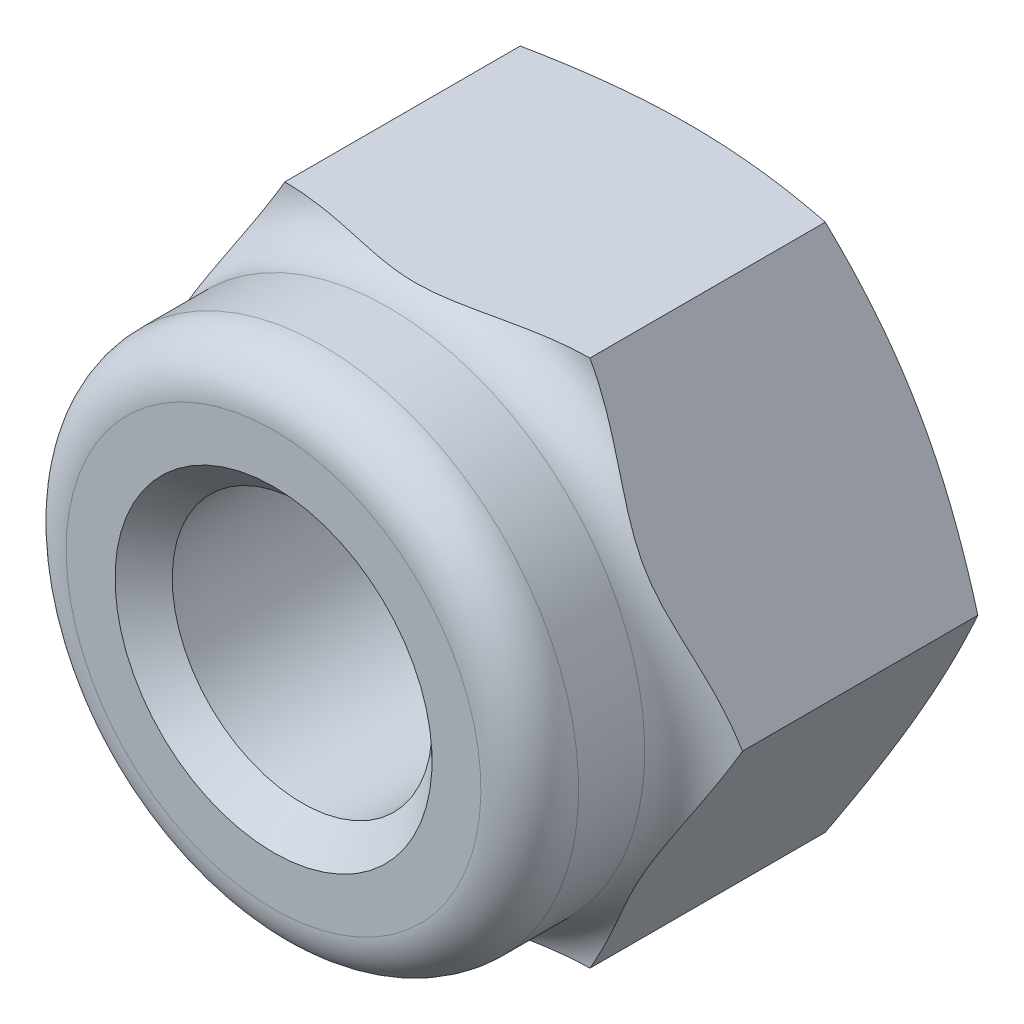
ISO-10303-21;
HEADER;
FILE_DESCRIPTION(('STEP AP214'),'2;1');
FILE_NAME('part.step','',(''),(''),'','','');
FILE_SCHEMA(('AUTOMOTIVE_DESIGN { 1 0 10303 214 1 1 1 1 }'));
ENDSEC;
DATA;
#1=APPLICATION_CONTEXT('core data for automotive mechanical design processes');
#2=APPLICATION_PROTOCOL_DEFINITION('international standard','automotive_design',2000,#1);
#3=PRODUCT_CONTEXT('',#1,'mechanical');
#4=PRODUCT('Part','Part','',(#3));
#5=PRODUCT_RELATED_PRODUCT_CATEGORY('part','',(#4));
#6=PRODUCT_DEFINITION_FORMATION('','',#4);
#7=PRODUCT_DEFINITION_CONTEXT('part definition',#1,'design');
#8=PRODUCT_DEFINITION('design','',#6,#7);
#9=PRODUCT_DEFINITION_SHAPE('','',#8);
#10=(LENGTH_UNIT() NAMED_UNIT(*) SI_UNIT(.MILLI.,.METRE.));
#11=(NAMED_UNIT(*) PLANE_ANGLE_UNIT() SI_UNIT($,.RADIAN.));
#12=(NAMED_UNIT(*) SI_UNIT($,.STERADIAN.) SOLID_ANGLE_UNIT());
#13=UNCERTAINTY_MEASURE_WITH_UNIT(LENGTH_MEASURE(1.E-05),#10,'distance_accuracy_value','');
#14=(GEOMETRIC_REPRESENTATION_CONTEXT(3) GLOBAL_UNCERTAINTY_ASSIGNED_CONTEXT((#13)) GLOBAL_UNIT_ASSIGNED_CONTEXT((#10,
#11,#12)) REPRESENTATION_CONTEXT('',''));
#15=CARTESIAN_POINT('',(0.,0.,0.));
#16=DIRECTION('',(0.,0.,1.));
#17=DIRECTION('',(1.,0.,0.));
#18=AXIS2_PLACEMENT_3D('',#15,#16,#17);
#19=CARTESIAN_POINT('',(0.,0.,0.));
#20=DIRECTION('',(0.,0.,1.));
#21=DIRECTION('',(0.,-1.,0.));
#22=AXIS2_PLACEMENT_3D('',#19,#20,#21);
#23=CONICAL_SURFACE('',#22,4.67096131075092,1.18682389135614);
#24=CARTESIAN_POINT('',(0.,0.,0.));
#25=DIRECTION('',(0.,0.,1.));
#26=DIRECTION('',(1.,0.,0.));
#27=AXIS2_PLACEMENT_3D('',#24,#25,#26);
#28=CIRCLE('',#27,4.67096131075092);
#29=CARTESIAN_POINT('',(4.67096131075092,0.,0.));
#30=VERTEX_POINT('',#29);
#31=EDGE_CURVE('E201',#30,#30,#28,.T.);
#32=ORIENTED_EDGE('',*,*,#31,.T.);
#33=EDGE_LOOP('',(#32));
#34=FACE_BOUND('',#33,.T.);
#35=CARTESIAN_POINT('',(2.88674988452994,4.99999786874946,0.445454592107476));
#36=CARTESIAN_POINT('',(2.98760513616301,4.82531144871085,0.404704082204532));
#37=CARTESIAN_POINT('',(3.08879327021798,4.65004845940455,0.36702368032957));
#38=CARTESIAN_POINT('',(3.29183863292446,4.29836357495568,0.298961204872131));
#39=CARTESIAN_POINT('',(3.39369621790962,4.12194106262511,0.26858340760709));
#40=CARTESIAN_POINT('',(3.59793549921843,3.7681882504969,0.216342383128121));
#41=CARTESIAN_POINT('',(3.70031703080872,3.59085823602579,0.194476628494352));
#42=CARTESIAN_POINT('',(3.90546039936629,3.23553949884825,0.160272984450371));
#43=CARTESIAN_POINT('',(4.00822214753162,3.0575509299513,0.147932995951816));
#44=CARTESIAN_POINT('',(4.21218124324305,2.70428341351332,0.133548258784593));
#45=CARTESIAN_POINT('',(4.31337552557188,2.52900977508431,0.13133225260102));
#46=CARTESIAN_POINT('',(4.51570428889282,2.17856607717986,0.136848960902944));
#47=CARTESIAN_POINT('',(4.61683876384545,2.00339602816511,0.14458255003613));
#48=CARTESIAN_POINT('',(4.81874245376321,1.65368857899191,0.169582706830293));
#49=CARTESIAN_POINT('',(4.91951185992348,1.47915084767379,0.186843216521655));
#50=CARTESIAN_POINT('',(5.12056954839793,1.13090871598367,0.230060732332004));
#51=CARTESIAN_POINT('',(5.220857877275,0.957204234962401,0.256016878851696));
#52=CARTESIAN_POINT('',(5.35868198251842,0.718485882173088,0.297046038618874));
#53=CARTESIAN_POINT('',(5.39646887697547,0.653037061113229,0.308852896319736));
#54=CARTESIAN_POINT('',(5.47195348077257,0.52229389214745,0.333494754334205));
#55=CARTESIAN_POINT('',(5.50965120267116,0.456999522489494,0.346329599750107));
#56=CARTESIAN_POINT('',(5.58508963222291,0.32633632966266,0.373013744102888));
#57=CARTESIAN_POINT('',(5.62283004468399,0.260968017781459,0.386866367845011));
#58=CARTESIAN_POINT('',(5.69822818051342,0.130374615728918,0.415488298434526));
#59=CARTESIAN_POINT('',(5.73588589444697,0.0651495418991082,0.430257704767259));
#60=CARTESIAN_POINT('',(5.77350011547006,-1.99999999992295E-07,0.445454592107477));
#61=B_SPLINE_CURVE_WITH_KNOTS('',3,(#35,#36,#37,#38,#39,#40,#41,#42,#43,#44,#45,#46,#47,#48,#49,
#50,#51,#52,#53,#54,#55,#56,#57,#58,#59,#60),.UNSPECIFIED.,.F.,.F.,(4,2,2,2,2,2,2,2,2,2,2,2,4),
(0.,0.617400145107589,1.23516095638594,1.85273820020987,2.47017931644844,3.07713614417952,
3.68414633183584,4.29077097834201,4.89733567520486,5.12680289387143,5.35623560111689,
5.5864543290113,5.81669808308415),.UNSPECIFIED.);
#62=CARTESIAN_POINT('',(2.88675,4.99999766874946,0.445454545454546));
#63=VERTEX_POINT('',#62);
#64=CARTESIAN_POINT('',(5.7735,0.,0.445454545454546));
#65=VERTEX_POINT('',#64);
#66=EDGE_CURVE('E43',#63,#65,#61,.T.);
#67=ORIENTED_EDGE('',*,*,#66,.T.);
#68=CARTESIAN_POINT('',(5.77350011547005,2.E-07,0.445454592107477));
#69=CARTESIAN_POINT('',(5.67264486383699,-0.174686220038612,0.404704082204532));
#70=CARTESIAN_POINT('',(5.57145672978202,-0.349949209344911,0.367023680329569));
#71=CARTESIAN_POINT('',(5.36841136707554,-0.701634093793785,0.298961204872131));
#72=CARTESIAN_POINT('',(5.26655378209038,-0.878056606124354,0.26858340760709));
#73=CARTESIAN_POINT('',(5.06231450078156,-1.23180941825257,0.216342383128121));
#74=CARTESIAN_POINT('',(4.95993296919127,-1.40913943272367,0.194476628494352));
#75=CARTESIAN_POINT('',(4.7547896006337,-1.76445816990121,0.160272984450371));
#76=CARTESIAN_POINT('',(4.65202785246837,-1.94244673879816,0.147932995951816));
#77=CARTESIAN_POINT('',(4.44806875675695,-2.29571425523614,0.133548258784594));
#78=CARTESIAN_POINT('',(4.34687447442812,-2.47098789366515,0.131332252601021));
#79=CARTESIAN_POINT('',(4.14454571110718,-2.8214315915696,0.136848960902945));
#80=CARTESIAN_POINT('',(4.04341123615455,-2.99660164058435,0.144582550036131));
#81=CARTESIAN_POINT('',(3.84150754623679,-3.34630908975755,0.169582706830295));
#82=CARTESIAN_POINT('',(3.74073814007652,-3.52084682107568,0.186843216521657));
#83=CARTESIAN_POINT('',(3.53968045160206,-3.86908895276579,0.230060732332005));
#84=CARTESIAN_POINT('',(3.43939212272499,-4.04279343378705,0.256016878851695));
#85=CARTESIAN_POINT('',(3.30156801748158,-4.28151178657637,0.297046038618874));
#86=CARTESIAN_POINT('',(3.26378112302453,-4.34696060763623,0.308852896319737));
#87=CARTESIAN_POINT('',(3.18829651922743,-4.47770377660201,0.333494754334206));
#88=CARTESIAN_POINT('',(3.15059879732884,-4.54299814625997,0.346329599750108));
#89=CARTESIAN_POINT('',(3.07516036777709,-4.6736613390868,0.373013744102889));
#90=CARTESIAN_POINT('',(3.03741995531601,-4.739029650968,0.386866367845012));
#91=CARTESIAN_POINT('',(2.96202181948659,-4.86962305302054,0.415488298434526));
#92=CARTESIAN_POINT('',(2.92436410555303,-4.93484812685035,0.43025770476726));
#93=CARTESIAN_POINT('',(2.88674988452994,-4.99999786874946,0.445454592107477));
#94=B_SPLINE_CURVE_WITH_KNOTS('',3,(#68,#69,#70,#71,#72,#73,#74,#75,#76,#77,#78,#79,#80,#81,#82,
#83,#84,#85,#86,#87,#88,#89,#90,#91,#92,#93),.UNSPECIFIED.,.F.,.F.,(4,2,2,2,2,2,2,2,2,2,2,2,4),
(0.,0.61740014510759,1.23516095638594,1.85273820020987,2.47017931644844,3.07713614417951,
3.68414633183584,4.290770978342,4.89733567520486,5.12680289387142,5.35623560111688,
5.5864543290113,5.81669808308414),.UNSPECIFIED.);
#95=CARTESIAN_POINT('',(2.88675,-4.99999766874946,0.445454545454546));
#96=VERTEX_POINT('',#95);
#97=EDGE_CURVE('E36',#65,#96,#94,.T.);
#98=ORIENTED_EDGE('',*,*,#97,.T.);
#99=CARTESIAN_POINT('',(-7.63337080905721,-4.99999766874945,1.79960824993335));
#100=CARTESIAN_POINT('',(-7.4078167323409,-4.99999766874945,1.72339808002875));
#101=CARTESIAN_POINT('',(-7.18196273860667,-4.99999766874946,1.648059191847));
#102=CARTESIAN_POINT('',(-6.72949973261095,-4.99999766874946,1.49961076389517));
#103=CARTESIAN_POINT('',(-6.50289064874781,-4.99999766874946,1.42650144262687));
#104=CARTESIAN_POINT('',(-6.04825855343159,-4.99999766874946,1.28284093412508));
#105=CARTESIAN_POINT('',(-5.82023344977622,-4.99999766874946,1.21229634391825));
#106=CARTESIAN_POINT('',(-5.36315385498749,-4.99999766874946,1.07463181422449));
#107=CARTESIAN_POINT('',(-5.13409938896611,-4.99999766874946,1.00751179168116));
#108=CARTESIAN_POINT('',(-4.67772509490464,-4.99999766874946,0.878394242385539));
#109=CARTESIAN_POINT('',(-4.45042084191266,-4.99999766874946,0.816341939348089));
#110=CARTESIAN_POINT('',(-3.99443004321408,-4.99999766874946,0.697475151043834));
#111=CARTESIAN_POINT('',(-3.76574345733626,-4.99999766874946,0.640660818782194));
#112=CARTESIAN_POINT('',(-3.30695458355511,-4.99999766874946,0.533626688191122));
#113=CARTESIAN_POINT('',(-3.07685316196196,-4.99999766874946,0.483403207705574));
#114=CARTESIAN_POINT('',(-2.6150147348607,-4.99999766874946,0.391102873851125));
#115=CARTESIAN_POINT('',(-2.38327784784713,-4.99999766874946,0.349025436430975));
#116=CARTESIAN_POINT('',(-1.96575941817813,-4.99999766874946,0.282370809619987));
#117=CARTESIAN_POINT('',(-1.78026976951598,-4.99999766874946,0.255974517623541));
#118=CARTESIAN_POINT('',(-1.40841693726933,-4.99999766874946,0.210334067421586));
#119=CARTESIAN_POINT('',(-1.22205382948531,-4.99999766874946,0.191089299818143));
#120=CARTESIAN_POINT('',(-0.848787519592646,-4.99999766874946,0.160510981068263));
#121=CARTESIAN_POINT('',(-0.661884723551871,-4.99999766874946,0.149172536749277));
#122=CARTESIAN_POINT('',(-0.287755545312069,-4.99999766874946,0.134883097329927));
#123=CARTESIAN_POINT('',(-0.100529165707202,-4.99999766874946,0.13193203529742));
#124=CARTESIAN_POINT('',(0.27476716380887,-4.99999766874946,0.134559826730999));
#125=CARTESIAN_POINT('',(0.462836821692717,-4.99999766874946,0.140179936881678));
#126=CARTESIAN_POINT('',(0.838537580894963,-4.99999766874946,0.159767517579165));
#127=CARTESIAN_POINT('',(1.02616867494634,-4.99999766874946,0.173735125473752));
#128=CARTESIAN_POINT('',(1.40080260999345,-4.99999766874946,0.209430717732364));
#129=CARTESIAN_POINT('',(1.58780497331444,-4.99999766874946,0.231163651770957));
#130=CARTESIAN_POINT('',(1.96085994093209,-4.99999766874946,0.281569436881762));
#131=CARTESIAN_POINT('',(2.1469125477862,-4.99999766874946,0.310242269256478));
#132=CARTESIAN_POINT('',(2.54890366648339,-4.99999766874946,0.378902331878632));
#133=CARTESIAN_POINT('',(2.7646549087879,-4.99999766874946,0.419978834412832));
#134=CARTESIAN_POINT('',(3.19475366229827,-4.99999766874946,0.508936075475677));
#135=CARTESIAN_POINT('',(3.40910104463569,-4.99999766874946,0.556817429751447));
#136=CARTESIAN_POINT('',(3.83658053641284,-4.99999766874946,0.658153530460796));
#137=CARTESIAN_POINT('',(4.04971196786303,-4.99999766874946,0.711611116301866));
#138=CARTESIAN_POINT('',(4.4747803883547,-4.99999766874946,0.823023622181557));
#139=CARTESIAN_POINT('',(4.68671742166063,-4.99999766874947,0.8809783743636));
#140=CARTESIAN_POINT('',(5.11011233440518,-4.99999766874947,1.00068641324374));
#141=CARTESIAN_POINT('',(5.32156749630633,-4.99999766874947,1.06244927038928));
#142=CARTESIAN_POINT('',(5.74358570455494,-4.99999766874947,1.18895328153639));
#143=CARTESIAN_POINT('',(5.95414873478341,-4.99999766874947,1.25369448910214));
#144=CARTESIAN_POINT('',(6.58457952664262,-4.99999766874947,1.45149835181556));
#145=CARTESIAN_POINT('',(7.00331175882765,-4.99999766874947,1.58817669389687));
#146=CARTESIAN_POINT('',(7.83579281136,-4.99999766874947,1.86712849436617));
#147=CARTESIAN_POINT('',(8.24955625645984,-4.99999766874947,2.00935873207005));
#148=CARTESIAN_POINT('',(9.07551816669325,-4.99999766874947,2.29838090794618));
#149=CARTESIAN_POINT('',(9.48771651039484,-4.99999766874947,2.44517319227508));
#150=CARTESIAN_POINT('',(10.3081941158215,-4.99999766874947,2.74106893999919));
#151=CARTESIAN_POINT('',(10.7164812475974,-4.99999766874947,2.89015064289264));
#152=CARTESIAN_POINT('',(11.3282135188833,-4.99999766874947,3.11558477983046));
#153=CARTESIAN_POINT('',(11.5319950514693,-4.99999766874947,3.19102661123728));
#154=CARTESIAN_POINT('',(11.9393592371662,-4.99999766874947,3.34244314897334));
#155=CARTESIAN_POINT('',(12.1429418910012,-4.99999766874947,3.41841785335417));
#156=CARTESIAN_POINT('',(12.346438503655,-4.99999766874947,3.49462227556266));
#157=B_SPLINE_CURVE_WITH_KNOTS('',3,(#99,#100,#101,#102,#103,#104,#105,#106,#107,#108,#109,#110,
#111,#112,#113,#114,#115,#116,#117,#118,#119,#120,#121,#122,#123,#124,#125,#126,#127,#128,#129,
#130,#131,#132,#133,#134,#135,#136,#137,#138,#139,#140,#141,#142,#143,#144,#145,#146,#147,#148,
#149,#150,#151,#152,#153,#154,#155,#156),.UNSPECIFIED.,.F.,.F.,(4,2,2,2,2,2,2,2,2,2,2,2,2,2,2,2,
2,2,2,2,2,2,2,2,2,2,2,2,4),(0.,0.714249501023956,1.42856877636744,2.14461135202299,
2.86063655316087,3.5674534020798,4.27429089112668,4.98073178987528,5.6871220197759,
6.24907762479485,6.81098533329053,7.37254497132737,7.93410012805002,8.49836683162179,
9.06264281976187,9.62727912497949,10.1919139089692,10.8506566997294,11.5094591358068,
12.1685986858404,12.827713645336,13.488558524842,14.1494152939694,15.470745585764,
16.7832945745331,18.0959434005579,19.3998940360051,20.0517871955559,20.7036779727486),.UNSPECIFIED.);
#158=CARTESIAN_POINT('',(-2.88675,-4.99999766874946,0.445454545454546));
#159=VERTEX_POINT('',#158);
#160=EDGE_CURVE('E81',#96,#159,#157,.F.);
#161=ORIENTED_EDGE('',*,*,#160,.T.);
#162=CARTESIAN_POINT('',(-2.88674988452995,-4.99999786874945,0.445454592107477));
#163=CARTESIAN_POINT('',(-2.98760513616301,-4.82531144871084,0.404704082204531));
#164=CARTESIAN_POINT('',(-3.08879327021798,-4.65004845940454,0.367023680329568));
#165=CARTESIAN_POINT('',(-3.29183863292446,-4.29836357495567,0.298961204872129));
#166=CARTESIAN_POINT('',(-3.39369621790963,-4.1219410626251,0.268583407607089));
#167=CARTESIAN_POINT('',(-3.59793549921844,-3.76818825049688,0.21634238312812));
#168=CARTESIAN_POINT('',(-3.70031703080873,-3.59085823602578,0.194476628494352));
#169=CARTESIAN_POINT('',(-3.9054603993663,-3.23553949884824,0.160272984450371));
#170=CARTESIAN_POINT('',(-4.00822214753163,-3.05755092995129,0.147932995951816));
#171=CARTESIAN_POINT('',(-4.21218124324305,-2.70428341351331,0.133548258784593));
#172=CARTESIAN_POINT('',(-4.31337552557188,-2.5290097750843,0.13133225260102));
#173=CARTESIAN_POINT('',(-4.51570428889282,-2.17856607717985,0.136848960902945));
#174=CARTESIAN_POINT('',(-4.61683876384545,-2.0033960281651,0.14458255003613));
#175=CARTESIAN_POINT('',(-4.81874245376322,-1.6536885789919,0.169582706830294));
#176=CARTESIAN_POINT('',(-4.91951185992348,-1.47915084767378,0.186843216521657));
#177=CARTESIAN_POINT('',(-5.12056954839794,-1.13090871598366,0.230060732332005));
#178=CARTESIAN_POINT('',(-5.22085787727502,-0.957204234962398,0.256016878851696));
#179=CARTESIAN_POINT('',(-5.35868198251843,-0.718485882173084,0.297046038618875));
#180=CARTESIAN_POINT('',(-5.39646887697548,-0.653037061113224,0.308852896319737));
#181=CARTESIAN_POINT('',(-5.47195348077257,-0.522293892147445,0.333494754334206));
#182=CARTESIAN_POINT('',(-5.50965120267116,-0.456999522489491,0.346329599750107));
#183=CARTESIAN_POINT('',(-5.58508963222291,-0.32633632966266,0.373013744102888));
#184=CARTESIAN_POINT('',(-5.62283004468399,-0.26096801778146,0.386866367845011));
#185=CARTESIAN_POINT('',(-5.69822818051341,-0.13037461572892,0.415488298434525));
#186=CARTESIAN_POINT('',(-5.73588589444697,-0.0651495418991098,0.430257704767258));
#187=CARTESIAN_POINT('',(-5.77350011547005,1.99999999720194E-07,0.445454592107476));
#188=B_SPLINE_CURVE_WITH_KNOTS('',3,(#162,#163,#164,#165,#166,#167,#168,#169,#170,#171,#172,
#173,#174,#175,#176,#177,#178,#179,#180,#181,#182,#183,#184,#185,#186,#187),.UNSPECIFIED.,.F.,
.F.,(4,2,2,2,2,2,2,2,2,2,2,2,4),(0.,0.61740014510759,1.23516095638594,1.85273820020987,
2.47017931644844,3.07713614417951,3.68414633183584,4.290770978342,4.89733567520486,
5.12680289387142,5.35623560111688,5.58645432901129,5.81669808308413),.UNSPECIFIED.);
#189=CARTESIAN_POINT('',(-5.7735,0.,0.445454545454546));
#190=VERTEX_POINT('',#189);
#191=EDGE_CURVE('E89',#159,#190,#188,.T.);
#192=ORIENTED_EDGE('',*,*,#191,.T.);
#193=CARTESIAN_POINT('',(-5.77350011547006,-1.99999999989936E-07,0.445454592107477));
#194=CARTESIAN_POINT('',(-5.67264486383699,0.174686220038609,0.404704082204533));
#195=CARTESIAN_POINT('',(-5.57145672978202,0.349949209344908,0.36702368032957));
#196=CARTESIAN_POINT('',(-5.36841136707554,0.701634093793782,0.298961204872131));
#197=CARTESIAN_POINT('',(-5.26655378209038,0.87805660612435,0.26858340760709));
#198=CARTESIAN_POINT('',(-5.06231450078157,1.23180941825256,0.216342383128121));
#199=CARTESIAN_POINT('',(-4.95993296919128,1.40913943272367,0.194476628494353));
#200=CARTESIAN_POINT('',(-4.75478960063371,1.76445816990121,0.160272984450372));
#201=CARTESIAN_POINT('',(-4.65202785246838,1.94244673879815,0.147932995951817));
#202=CARTESIAN_POINT('',(-4.44806875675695,2.29571425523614,0.133548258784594));
#203=CARTESIAN_POINT('',(-4.34687447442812,2.47098789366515,0.131332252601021));
#204=CARTESIAN_POINT('',(-4.14454571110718,2.8214315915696,0.136848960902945));
#205=CARTESIAN_POINT('',(-4.04341123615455,2.99660164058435,0.144582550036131));
#206=CARTESIAN_POINT('',(-3.84150754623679,3.34630908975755,0.169582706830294));
#207=CARTESIAN_POINT('',(-3.74073814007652,3.52084682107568,0.186843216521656));
#208=CARTESIAN_POINT('',(-3.53968045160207,3.86908895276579,0.230060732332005));
#209=CARTESIAN_POINT('',(-3.43939212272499,4.04279343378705,0.256016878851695));
#210=CARTESIAN_POINT('',(-3.30156801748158,4.28151178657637,0.297046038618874));
#211=CARTESIAN_POINT('',(-3.26378112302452,4.34696060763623,0.308852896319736));
#212=CARTESIAN_POINT('',(-3.18829651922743,4.47770377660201,0.333494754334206));
#213=CARTESIAN_POINT('',(-3.15059879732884,4.54299814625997,0.346329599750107));
#214=CARTESIAN_POINT('',(-3.07516036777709,4.6736613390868,0.373013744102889));
#215=CARTESIAN_POINT('',(-3.03741995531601,4.739029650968,0.386866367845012));
#216=CARTESIAN_POINT('',(-2.96202181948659,4.86962305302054,0.415488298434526));
#217=CARTESIAN_POINT('',(-2.92436410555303,4.93484812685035,0.430257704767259));
#218=CARTESIAN_POINT('',(-2.88674988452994,4.99999786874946,0.445454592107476));
#219=B_SPLINE_CURVE_WITH_KNOTS('',3,(#193,#194,#195,#196,#197,#198,#199,#200,#201,#202,#203,
#204,#205,#206,#207,#208,#209,#210,#211,#212,#213,#214,#215,#216,#217,#218),.UNSPECIFIED.,.F.,
.F.,(4,2,2,2,2,2,2,2,2,2,2,2,4),(0.,0.61740014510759,1.23516095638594,1.85273820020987,
2.47017931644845,3.07713614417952,3.68414633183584,4.29077097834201,4.89733567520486,
5.12680289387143,5.35623560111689,5.5864543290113,5.81669808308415),.UNSPECIFIED.);
#220=CARTESIAN_POINT('',(-2.88675,4.99999766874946,0.445454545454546));
#221=VERTEX_POINT('',#220);
#222=EDGE_CURVE('E94',#190,#221,#219,.T.);
#223=ORIENTED_EDGE('',*,*,#222,.T.);
#224=CARTESIAN_POINT('',(-7.6333708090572,4.99999766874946,1.79960824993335));
#225=CARTESIAN_POINT('',(-7.40781673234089,4.99999766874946,1.72339808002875));
#226=CARTESIAN_POINT('',(-7.18196273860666,4.99999766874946,1.648059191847));
#227=CARTESIAN_POINT('',(-6.72949973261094,4.99999766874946,1.49961076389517));
#228=CARTESIAN_POINT('',(-6.5028906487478,4.99999766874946,1.42650144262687));
#229=CARTESIAN_POINT('',(-6.04825855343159,4.99999766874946,1.28284093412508));
#230=CARTESIAN_POINT('',(-5.82023344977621,4.99999766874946,1.21229634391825));
#231=CARTESIAN_POINT('',(-5.36315385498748,4.99999766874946,1.07463181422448));
#232=CARTESIAN_POINT('',(-5.1340993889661,4.99999766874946,1.00751179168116));
#233=CARTESIAN_POINT('',(-4.67772509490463,4.99999766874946,0.878394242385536));
#234=CARTESIAN_POINT('',(-4.45042084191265,4.99999766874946,0.816341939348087));
#235=CARTESIAN_POINT('',(-3.99443004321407,4.99999766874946,0.697475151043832));
#236=CARTESIAN_POINT('',(-3.76574345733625,4.99999766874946,0.640660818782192));
#237=CARTESIAN_POINT('',(-3.3069545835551,4.99999766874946,0.533626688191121));
#238=CARTESIAN_POINT('',(-3.07685316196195,4.99999766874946,0.483403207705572));
#239=CARTESIAN_POINT('',(-2.6150147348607,4.99999766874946,0.391102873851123));
#240=CARTESIAN_POINT('',(-2.38327784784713,4.99999766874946,0.349025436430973));
#241=CARTESIAN_POINT('',(-1.96575941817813,4.99999766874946,0.282370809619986));
#242=CARTESIAN_POINT('',(-1.78026976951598,4.99999766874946,0.25597451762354));
#243=CARTESIAN_POINT('',(-1.40841693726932,4.99999766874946,0.210334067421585));
#244=CARTESIAN_POINT('',(-1.22205382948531,4.99999766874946,0.191089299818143));
#245=CARTESIAN_POINT('',(-0.848787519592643,4.99999766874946,0.160510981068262));
#246=CARTESIAN_POINT('',(-0.661884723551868,4.99999766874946,0.149172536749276));
#247=CARTESIAN_POINT('',(-0.287755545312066,4.99999766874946,0.134883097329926));
#248=CARTESIAN_POINT('',(-0.100529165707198,4.99999766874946,0.131932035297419));
#249=CARTESIAN_POINT('',(0.274767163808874,4.99999766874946,0.134559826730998));
#250=CARTESIAN_POINT('',(0.462836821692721,4.99999766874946,0.140179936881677));
#251=CARTESIAN_POINT('',(0.838537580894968,4.99999766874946,0.159767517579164));
#252=CARTESIAN_POINT('',(1.02616867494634,4.99999766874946,0.173735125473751));
#253=CARTESIAN_POINT('',(1.40080260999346,4.99999766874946,0.209430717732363));
#254=CARTESIAN_POINT('',(1.58780497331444,4.99999766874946,0.231163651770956));
#255=CARTESIAN_POINT('',(1.96085994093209,4.99999766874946,0.281569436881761));
#256=CARTESIAN_POINT('',(2.14691254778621,4.99999766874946,0.310242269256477));
#257=CARTESIAN_POINT('',(2.5489036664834,4.99999766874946,0.378902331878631));
#258=CARTESIAN_POINT('',(2.7646549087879,4.99999766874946,0.419978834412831));
#259=CARTESIAN_POINT('',(3.19475366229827,4.99999766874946,0.508936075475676));
#260=CARTESIAN_POINT('',(3.40910104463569,4.99999766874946,0.556817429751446));
#261=CARTESIAN_POINT('',(3.83658053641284,4.99999766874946,0.658153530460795));
#262=CARTESIAN_POINT('',(4.04971196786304,4.99999766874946,0.711611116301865));
#263=CARTESIAN_POINT('',(4.47478038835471,4.99999766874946,0.823023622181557));
#264=CARTESIAN_POINT('',(4.68671742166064,4.99999766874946,0.8809783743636));
#265=CARTESIAN_POINT('',(5.11011233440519,4.99999766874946,1.00068641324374));
#266=CARTESIAN_POINT('',(5.32156749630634,4.99999766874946,1.06244927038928));
#267=CARTESIAN_POINT('',(5.74358570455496,4.99999766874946,1.18895328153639));
#268=CARTESIAN_POINT('',(5.95414873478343,4.99999766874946,1.25369448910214));
#269=CARTESIAN_POINT('',(6.58457952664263,4.99999766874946,1.45149835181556));
#270=CARTESIAN_POINT('',(7.00331175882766,4.99999766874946,1.58817669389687));
#271=CARTESIAN_POINT('',(7.83579281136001,4.99999766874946,1.86712849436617));
#272=CARTESIAN_POINT('',(8.24955625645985,4.99999766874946,2.00935873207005));
#273=CARTESIAN_POINT('',(9.07551816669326,4.99999766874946,2.29838090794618));
#274=CARTESIAN_POINT('',(9.48771651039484,4.99999766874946,2.44517319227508));
#275=CARTESIAN_POINT('',(10.3081941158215,4.99999766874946,2.74106893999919));
#276=CARTESIAN_POINT('',(10.7164812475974,4.99999766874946,2.89015064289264));
#277=CARTESIAN_POINT('',(11.3282135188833,4.99999766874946,3.11558477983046));
#278=CARTESIAN_POINT('',(11.5319950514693,4.99999766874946,3.19102661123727));
#279=CARTESIAN_POINT('',(11.9393592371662,4.99999766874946,3.34244314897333));
#280=CARTESIAN_POINT('',(12.1429418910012,4.99999766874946,3.41841785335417));
#281=CARTESIAN_POINT('',(12.346438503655,4.99999766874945,3.49462227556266));
#282=B_SPLINE_CURVE_WITH_KNOTS('',3,(#224,#225,#226,#227,#228,#229,#230,#231,#232,#233,#234,
#235,#236,#237,#238,#239,#240,#241,#242,#243,#244,#245,#246,#247,#248,#249,#250,#251,#252,#253,
#254,#255,#256,#257,#258,#259,#260,#261,#262,#263,#264,#265,#266,#267,#268,#269,#270,#271,#272,
#273,#274,#275,#276,#277,#278,#279,#280,#281),.UNSPECIFIED.,.F.,.F.,(4,2,2,2,2,2,2,2,2,2,2,2,2,
2,2,2,2,2,2,2,2,2,2,2,2,2,2,2,4),(0.,0.714249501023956,1.42856877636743,2.14461135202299,
2.86063655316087,3.5674534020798,4.27429089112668,4.98073178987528,5.6871220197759,
6.24907762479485,6.81098533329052,7.37254497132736,7.93410012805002,8.49836683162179,
9.06264281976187,9.62727912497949,10.1919139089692,10.8506566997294,11.5094591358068,
12.1685986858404,12.827713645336,13.488558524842,14.1494152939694,15.470745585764,
16.7832945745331,18.0959434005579,19.3998940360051,20.0517871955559,20.7036779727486),.UNSPECIFIED.);
#283=EDGE_CURVE('E179',#221,#63,#282,.T.);
#284=ORIENTED_EDGE('',*,*,#283,.T.);
#285=EDGE_LOOP('',(#67,#98,#161,#192,#223,#284));
#286=FACE_BOUND('',#285,.T.);
#287=ADVANCED_FACE('F16',(#34,#286),#23,.T.);
#288=CARTESIAN_POINT('',(5.7735,0.,0.));
#289=DIRECTION('',(0.,0.,1.));
#290=DIRECTION('',(1.,0.,0.));
#291=AXIS2_PLACEMENT_3D('',#288,#289,#290);
#292=PLANE('',#291);
#293=CARTESIAN_POINT('',(0.,0.,0.));
#294=DIRECTION('',(0.,0.,1.));
#295=DIRECTION('',(1.,0.,0.));
#296=AXIS2_PLACEMENT_3D('',#293,#294,#295);
#297=CIRCLE('',#296,3.);
#298=CARTESIAN_POINT('',(3.,0.,0.));
#299=VERTEX_POINT('',#298);
#300=EDGE_CURVE('E204',#299,#299,#297,.F.);
#301=ORIENTED_EDGE('',*,*,#300,.F.);
#302=EDGE_LOOP('',(#301));
#303=FACE_BOUND('',#302,.T.);
#304=ORIENTED_EDGE('',*,*,#31,.F.);
#305=EDGE_LOOP('',(#304));
#306=FACE_BOUND('',#305,.T.);
#307=ADVANCED_FACE('F223',(#303,#306),#292,.F.);
#308=CARTESIAN_POINT('',(0.,0.,8.));
#309=DIRECTION('',(0.,0.,1.));
#310=DIRECTION('',(0.,-1.,0.));
#311=AXIS2_PLACEMENT_3D('',#308,#309,#310);
#312=CONICAL_SURFACE('',#311,3.,0.785398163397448);
#313=CARTESIAN_POINT('',(0.,0.,7.45875));
#314=DIRECTION('',(0.,0.,-1.));
#315=DIRECTION('',(0.,1.,0.));
#316=AXIS2_PLACEMENT_3D('',#313,#314,#315);
#317=CIRCLE('',#316,2.45875);
#318=CARTESIAN_POINT('',(0.,2.45875,7.45875));
#319=VERTEX_POINT('',#318);
#320=EDGE_CURVE('E243',#319,#319,#317,.T.);
#321=ORIENTED_EDGE('',*,*,#320,.T.);
#322=EDGE_LOOP('',(#321));
#323=FACE_BOUND('',#322,.T.);
#324=CARTESIAN_POINT('',(0.,0.,8.));
#325=DIRECTION('',(0.,0.,-1.));
#326=DIRECTION('',(0.,1.,0.));
#327=AXIS2_PLACEMENT_3D('',#324,#325,#326);
#328=CIRCLE('',#327,3.);
#329=CARTESIAN_POINT('',(0.,3.,8.));
#330=VERTEX_POINT('',#329);
#331=EDGE_CURVE('E246',#330,#330,#328,.T.);
#332=ORIENTED_EDGE('',*,*,#331,.F.);
#333=EDGE_LOOP('',(#332));
#334=FACE_BOUND('',#333,.T.);
#335=ADVANCED_FACE('F228',(#323,#334),#312,.F.);
#336=CARTESIAN_POINT('',(0.,0.,0.));
#337=DIRECTION('',(0.,0.,-1.));
#338=DIRECTION('',(0.,1.,0.));
#339=AXIS2_PLACEMENT_3D('',#336,#337,#338);
#340=CYLINDRICAL_SURFACE('',#339,2.45875);
#341=CARTESIAN_POINT('',(0.,0.,0.54125));
#342=DIRECTION('',(0.,0.,-1.));
#343=DIRECTION('',(0.,1.,0.));
#344=AXIS2_PLACEMENT_3D('',#341,#342,#343);
#345=CIRCLE('',#344,2.45875);
#346=CARTESIAN_POINT('',(0.,2.45875,0.54125));
#347=VERTEX_POINT('',#346);
#348=EDGE_CURVE('E241',#347,#347,#345,.T.);
#349=ORIENTED_EDGE('',*,*,#348,.T.);
#350=EDGE_LOOP('',(#349));
#351=FACE_BOUND('',#350,.T.);
#352=ORIENTED_EDGE('',*,*,#320,.F.);
#353=EDGE_LOOP('',(#352));
#354=FACE_BOUND('',#353,.T.);
#355=ADVANCED_FACE('F219',(#351,#354),#340,.F.);
#356=CARTESIAN_POINT('',(0.,0.,0.54125));
#357=DIRECTION('',(0.,0.,-1.));
#358=DIRECTION('',(0.,1.,0.));
#359=AXIS2_PLACEMENT_3D('',#356,#357,#358);
#360=CONICAL_SURFACE('',#359,2.45875,0.785398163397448);
#361=ORIENTED_EDGE('',*,*,#300,.T.);
#362=EDGE_LOOP('',(#361));
#363=FACE_BOUND('',#362,.T.);
#364=ORIENTED_EDGE('',*,*,#348,.F.);
#365=EDGE_LOOP('',(#364));
#366=FACE_BOUND('',#365,.T.);
#367=ADVANCED_FACE('F213',(#363,#366),#360,.F.);
#368=CARTESIAN_POINT('',(5.7735,0.,8.));
#369=DIRECTION('',(0.,0.,1.));
#370=DIRECTION('',(1.,0.,0.));
#371=AXIS2_PLACEMENT_3D('',#368,#369,#370);
#372=PLANE('',#371);
#373=ORIENTED_EDGE('',*,*,#331,.T.);
#374=EDGE_LOOP('',(#373));
#375=FACE_BOUND('',#374,.T.);
#376=CARTESIAN_POINT('',(0.,0.,8.));
#377=DIRECTION('',(0.,0.,-1.));
#378=DIRECTION('',(0.,1.,0.));
#379=AXIS2_PLACEMENT_3D('',#376,#377,#378);
#380=CIRCLE('',#379,3.9245);
#381=CARTESIAN_POINT('',(0.,3.9245,8.));
#382=VERTEX_POINT('',#381);
#383=EDGE_CURVE('E29',#382,#382,#380,.T.);
#384=ORIENTED_EDGE('',*,*,#383,.F.);
#385=EDGE_LOOP('',(#384));
#386=FACE_BOUND('',#385,.T.);
#387=ADVANCED_FACE('F116',(#375,#386),#372,.T.);
#388=CARTESIAN_POINT('',(0.,0.,5.8245));
#389=DIRECTION('',(0.,0.,-1.));
#390=DIRECTION('',(0.,1.,0.));
#391=AXIS2_PLACEMENT_3D('',#388,#389,#390);
#392=TOROIDAL_SURFACE('',#391,5.7735,0.9245);
#393=CARTESIAN_POINT('',(0.,0.,5.8245));
#394=DIRECTION('',(0.,0.,-1.));
#395=DIRECTION('',(0.,1.,0.));
#396=AXIS2_PLACEMENT_3D('',#393,#394,#395);
#397=CIRCLE('',#396,4.849);
#398=CARTESIAN_POINT('',(0.,4.849,5.8245));
#399=VERTEX_POINT('',#398);
#400=EDGE_CURVE('E96',#399,#399,#397,.T.);
#401=ORIENTED_EDGE('',*,*,#400,.T.);
#402=EDGE_LOOP('',(#401));
#403=FACE_BOUND('',#402,.T.);
#404=CARTESIAN_POINT('',(5.77350011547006,2.00000000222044E-07,4.9));
#405=CARTESIAN_POINT('',(5.73621126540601,-0.0645859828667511,4.90001445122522));
#406=CARTESIAN_POINT('',(5.6989430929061,-0.129136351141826,4.90225394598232));
#407=CARTESIAN_POINT('',(5.62454294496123,-0.258001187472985,4.91051179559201));
#408=CARTESIAN_POINT('',(5.58741087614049,-0.322315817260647,4.9165266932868));
#409=CARTESIAN_POINT('',(5.47646933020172,-0.514472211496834,4.93919348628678));
#410=CARTESIAN_POINT('',(5.4029019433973,-0.641894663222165,4.96047520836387));
#411=CARTESIAN_POINT('',(5.25663559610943,-0.895235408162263,5.01080156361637));
#412=CARTESIAN_POINT('',(5.18393522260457,-1.02115614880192,5.03983098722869));
#413=CARTESIAN_POINT('',(5.03865415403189,-1.2727903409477,5.101358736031));
#414=CARTESIAN_POINT('',(4.96607473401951,-1.39850158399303,5.13386866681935));
#415=CARTESIAN_POINT('',(4.85400057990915,-1.59261971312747,5.18229100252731));
#416=CARTESIAN_POINT('',(4.81459144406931,-1.66087833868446,5.1989802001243));
#417=CARTESIAN_POINT('',(4.73558190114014,-1.79772688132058,5.23054169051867));
#418=CARTESIAN_POINT('',(4.6959814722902,-1.8663168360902,5.24541377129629));
#419=CARTESIAN_POINT('',(4.61669875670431,-2.00363852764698,5.271914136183));
#420=CARTESIAN_POINT('',(4.57701780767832,-2.07236794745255,5.28355786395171));
#421=CARTESIAN_POINT('',(4.49738940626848,-2.21028838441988,5.30225631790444));
#422=CARTESIAN_POINT('',(4.45744206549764,-2.27947920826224,5.30931285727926));
#423=CARTESIAN_POINT('',(4.37736445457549,-2.41817769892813,5.3177333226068));
#424=CARTESIAN_POINT('',(4.33723408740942,-2.48768553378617,5.31909376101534));
#425=CARTESIAN_POINT('',(4.25703166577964,-2.626600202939,5.31586929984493));
#426=CARTESIAN_POINT('',(4.21695961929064,-2.69600702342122,5.31128365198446));
#427=CARTESIAN_POINT('',(4.13688073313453,-2.83470772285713,5.29691447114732));
#428=CARTESIAN_POINT('',(4.0968749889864,-2.90399970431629,5.28710775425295));
#429=CARTESIAN_POINT('',(4.01714879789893,-3.04208951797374,5.26365822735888));
#430=CARTESIAN_POINT('',(3.97742841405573,-3.11088724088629,5.25001459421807));
#431=CARTESIAN_POINT('',(3.89454878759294,-3.25443896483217,5.21895767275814));
#432=CARTESIAN_POINT('',(3.85141197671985,-3.32915411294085,5.20131221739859));
#433=CARTESIAN_POINT('',(3.76527826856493,-3.47834207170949,5.16478168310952));
#434=CARTESIAN_POINT('',(3.72228135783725,-3.55281490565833,5.14589672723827));
#435=CARTESIAN_POINT('',(3.6364089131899,-3.70155034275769,5.10824787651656));
#436=CARTESIAN_POINT('',(3.59353340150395,-3.77581290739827,5.08948378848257));
#437=CARTESIAN_POINT('',(3.5076620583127,-3.9245464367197,5.0530971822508));
#438=CARTESIAN_POINT('',(3.46466623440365,-3.99901738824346,5.03547459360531));
#439=CARTESIAN_POINT('',(3.37766105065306,-4.14971478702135,5.00201150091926));
#440=CARTESIAN_POINT('',(3.33364780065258,-4.2259479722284,4.98621059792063));
#441=CARTESIAN_POINT('',(3.24538077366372,-4.37883094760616,4.95775147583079));
#442=CARTESIAN_POINT('',(3.20112709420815,-4.45548056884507,4.94509206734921));
#443=CARTESIAN_POINT('',(3.11197893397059,-4.60988971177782,4.92379478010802));
#444=CARTESIAN_POINT('',(3.06708221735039,-4.68765310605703,4.91519249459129));
#445=CARTESIAN_POINT('',(2.97705341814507,-4.84358756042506,4.90330653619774));
#446=CARTESIAN_POINT('',(2.93192108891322,-4.92175904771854,4.90003058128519));
#447=CARTESIAN_POINT('',(2.88674988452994,-4.99999786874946,4.9));
#448=B_SPLINE_CURVE_WITH_KNOTS('',3,(#404,#405,#406,#407,#408,#409,#410,#411,#412,#413,#414,
#415,#416,#417,#418,#419,#420,#421,#422,#423,#424,#425,#426,#427,#428,#429,#430,#431,#432,#433,
#434,#435,#436,#437,#438,#439,#440,#441,#442,#443,#444,#445,#446,#447),.UNSPECIFIED.,.F.,.F.,(4,
2,2,2,2,2,2,2,2,2,2,2,2,2,2,2,2,2,2,2,2,4),(0.,0.223639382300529,0.447074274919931,
0.892673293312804,1.33740390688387,1.78366658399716,2.02535625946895,2.26707410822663,
2.50761486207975,2.74806047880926,2.98865329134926,3.22927638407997,3.47097697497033,
3.7127294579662,3.97688532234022,4.24101500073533,4.50435346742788,4.76767566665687,
5.03593424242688,5.30409109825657,5.57455864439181,5.84541775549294),.UNSPECIFIED.);
#449=CARTESIAN_POINT('',(5.7735,0.,4.9));
#450=VERTEX_POINT('',#449);
#451=CARTESIAN_POINT('',(2.88675,-4.99999766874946,4.9));
#452=VERTEX_POINT('',#451);
#453=EDGE_CURVE('E164',#450,#452,#448,.T.);
#454=ORIENTED_EDGE('',*,*,#453,.F.);
#455=CARTESIAN_POINT('',(2.88674988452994,4.99999786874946,4.9));
#456=CARTESIAN_POINT('',(2.92403873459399,4.93541168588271,4.90001445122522));
#457=CARTESIAN_POINT('',(2.9613069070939,4.87086131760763,4.90225394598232));
#458=CARTESIAN_POINT('',(3.03570705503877,4.74199648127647,4.91051179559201));
#459=CARTESIAN_POINT('',(3.07283912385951,4.67768185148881,4.9165266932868));
#460=CARTESIAN_POINT('',(3.18378066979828,4.48552545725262,4.93919348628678));
#461=CARTESIAN_POINT('',(3.2573480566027,4.35810300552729,4.96047520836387));
#462=CARTESIAN_POINT('',(3.40361440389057,4.10476226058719,5.01080156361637));
#463=CARTESIAN_POINT('',(3.47631477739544,3.97884151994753,5.03983098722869));
#464=CARTESIAN_POINT('',(3.62159584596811,3.72720732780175,5.101358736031));
#465=CARTESIAN_POINT('',(3.69417526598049,3.60149608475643,5.13386866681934));
#466=CARTESIAN_POINT('',(3.80624942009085,3.40737795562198,5.18229100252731));
#467=CARTESIAN_POINT('',(3.84565855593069,3.33911933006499,5.1989802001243));
#468=CARTESIAN_POINT('',(3.92466809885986,3.20227078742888,5.23054169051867));
#469=CARTESIAN_POINT('',(3.96426852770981,3.13368083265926,5.24541377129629));
#470=CARTESIAN_POINT('',(4.04355124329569,2.99635914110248,5.271914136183));
#471=CARTESIAN_POINT('',(4.08323219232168,2.92762972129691,5.28355786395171));
#472=CARTESIAN_POINT('',(4.16286059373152,2.78970928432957,5.30225631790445));
#473=CARTESIAN_POINT('',(4.20280793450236,2.72051846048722,5.30931285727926));
#474=CARTESIAN_POINT('',(4.28288554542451,2.58181996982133,5.3177333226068));
#475=CARTESIAN_POINT('',(4.32301591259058,2.51231213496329,5.31909376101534));
#476=CARTESIAN_POINT('',(4.40321833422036,2.37339746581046,5.31586929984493));
#477=CARTESIAN_POINT('',(4.44329038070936,2.30399064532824,5.31128365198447));
#478=CARTESIAN_POINT('',(4.52336926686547,2.16528994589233,5.29691447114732));
#479=CARTESIAN_POINT('',(4.5633750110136,2.09599796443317,5.28710775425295));
#480=CARTESIAN_POINT('',(4.64310120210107,1.95790815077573,5.26365822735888));
#481=CARTESIAN_POINT('',(4.68282158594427,1.88911042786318,5.25001459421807));
#482=CARTESIAN_POINT('',(4.76570121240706,1.7455587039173,5.21895767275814));
#483=CARTESIAN_POINT('',(4.80883802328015,1.67084355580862,5.20131221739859));
#484=CARTESIAN_POINT('',(4.89497173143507,1.52165559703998,5.16478168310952));
#485=CARTESIAN_POINT('',(4.93796864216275,1.44718276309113,5.14589672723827));
#486=CARTESIAN_POINT('',(5.0238410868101,1.29844732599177,5.10824787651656));
#487=CARTESIAN_POINT('',(5.06671659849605,1.22418476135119,5.08948378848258));
#488=CARTESIAN_POINT('',(5.1525879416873,1.07545123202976,5.0530971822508));
#489=CARTESIAN_POINT('',(5.19558376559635,1.000980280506,5.03547459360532));
#490=CARTESIAN_POINT('',(5.28258894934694,0.850282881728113,5.00201150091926));
#491=CARTESIAN_POINT('',(5.32660219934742,0.774049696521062,4.98621059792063));
#492=CARTESIAN_POINT('',(5.41486922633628,0.621166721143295,4.95775147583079));
#493=CARTESIAN_POINT('',(5.45912290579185,0.544517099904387,4.94509206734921));
#494=CARTESIAN_POINT('',(5.54827106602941,0.390107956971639,4.92379478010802));
#495=CARTESIAN_POINT('',(5.59316778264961,0.312344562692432,4.91519249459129));
#496=CARTESIAN_POINT('',(5.68319658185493,0.156410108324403,4.90330653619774));
#497=CARTESIAN_POINT('',(5.72832891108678,0.078238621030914,4.90003058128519));
#498=CARTESIAN_POINT('',(5.77350011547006,-1.99999999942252E-07,4.9));
#499=B_SPLINE_CURVE_WITH_KNOTS('',3,(#455,#456,#457,#458,#459,#460,#461,#462,#463,#464,#465,
#466,#467,#468,#469,#470,#471,#472,#473,#474,#475,#476,#477,#478,#479,#480,#481,#482,#483,#484,
#485,#486,#487,#488,#489,#490,#491,#492,#493,#494,#495,#496,#497,#498),.UNSPECIFIED.,.F.,.F.,(4,
2,2,2,2,2,2,2,2,2,2,2,2,2,2,2,2,2,2,2,2,4),(0.,0.22363938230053,0.447074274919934,
0.892673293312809,1.33740390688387,1.78366658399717,2.02535625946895,2.26707410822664,
2.50761486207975,2.74806047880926,2.98865329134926,3.22927638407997,3.47097697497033,
3.71272945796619,3.97688532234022,4.24101500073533,4.50435346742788,4.76767566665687,
5.03593424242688,5.30409109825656,5.5745586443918,5.84541775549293),.UNSPECIFIED.);
#500=CARTESIAN_POINT('',(2.88675,4.99999766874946,4.9));
#501=VERTEX_POINT('',#500);
#502=EDGE_CURVE('E159',#501,#450,#499,.T.);
#503=ORIENTED_EDGE('',*,*,#502,.F.);
#504=CARTESIAN_POINT('',(0.,4.99999766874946,5.31814598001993));
#505=CARTESIAN_POINT('',(0.0644295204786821,4.99999766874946,5.31814530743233));
#506=CARTESIAN_POINT('',(0.128860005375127,4.99999766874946,5.31622428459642));
#507=CARTESIAN_POINT('',(0.257510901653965,4.99999766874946,5.30876039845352));
#508=CARTESIAN_POINT('',(0.321731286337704,4.99999766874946,5.30321709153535));
#509=CARTESIAN_POINT('',(0.514129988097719,4.99999766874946,5.28196189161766));
#510=CARTESIAN_POINT('',(0.641780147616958,4.99999766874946,5.26162858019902));
#511=CARTESIAN_POINT('',(0.89767162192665,4.99999766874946,5.21426478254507));
#512=CARTESIAN_POINT('',(1.025893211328,4.99999766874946,5.18713865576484));
#513=CARTESIAN_POINT('',(1.28191428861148,4.99999766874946,5.13154794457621));
#514=CARTESIAN_POINT('',(1.40971406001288,4.99999766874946,5.10308464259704));
#515=CARTESIAN_POINT('',(1.66580555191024,4.99999766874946,5.04854303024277));
#516=CARTESIAN_POINT('',(1.7940971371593,4.99999766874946,5.02246410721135));
#517=CARTESIAN_POINT('',(2.05181009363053,4.99999766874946,4.97577892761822));
#518=CARTESIAN_POINT('',(2.18123216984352,4.99999766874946,4.95517638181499));
#519=CARTESIAN_POINT('',(2.44038044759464,4.99999766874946,4.92261636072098));
#520=CARTESIAN_POINT('',(2.57009955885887,4.99999766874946,4.91060507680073));
#521=CARTESIAN_POINT('',(2.83006710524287,4.99999766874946,4.89838061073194));
#522=CARTESIAN_POINT('',(2.96031449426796,4.99999766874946,4.89815027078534));
#523=CARTESIAN_POINT('',(3.15603225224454,4.99999766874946,4.90984274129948));
#524=CARTESIAN_POINT('',(3.22185840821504,4.99999766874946,4.9158445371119));
#525=CARTESIAN_POINT('',(3.35287903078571,4.99999766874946,4.93266412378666));
#526=CARTESIAN_POINT('',(3.41807383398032,4.99999766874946,4.94347918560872));
#527=CARTESIAN_POINT('',(3.54704822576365,4.99999766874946,4.97066254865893));
#528=CARTESIAN_POINT('',(3.61083242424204,4.99999766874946,4.98700851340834));
#529=CARTESIAN_POINT('',(3.73634576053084,4.99999766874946,5.02616752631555));
#530=CARTESIAN_POINT('',(3.79807755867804,4.99999766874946,5.04897180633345));
#531=CARTESIAN_POINT('',(3.90779399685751,4.99999766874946,5.09747656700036));
#532=CARTESIAN_POINT('',(3.95630147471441,4.99999766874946,5.12198244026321));
#533=CARTESIAN_POINT('',(4.05003910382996,4.99999766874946,5.17679173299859));
#534=CARTESIAN_POINT('',(4.09526655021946,4.99999766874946,5.2070998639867));
#535=CARTESIAN_POINT('',(4.18130157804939,4.99999766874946,5.27443121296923));
#536=CARTESIAN_POINT('',(4.2220557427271,4.99999766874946,5.31152387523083));
#537=CARTESIAN_POINT('',(4.29623029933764,4.99999766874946,5.39244665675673));
#538=CARTESIAN_POINT('',(4.32966933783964,4.99999766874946,5.436259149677));
#539=CARTESIAN_POINT('',(4.37750716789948,4.99999766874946,5.51536402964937));
#540=CARTESIAN_POINT('',(4.39458987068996,4.99999766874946,5.54903397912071));
#541=CARTESIAN_POINT('',(4.4229914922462,4.99999766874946,5.61873637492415));
#542=CARTESIAN_POINT('',(4.43431463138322,4.99999766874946,5.65476706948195));
#543=CARTESIAN_POINT('',(4.45044358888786,4.99999766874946,5.72847895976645));
#544=CARTESIAN_POINT('',(4.45521472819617,4.99999766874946,5.76616785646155));
#545=CARTESIAN_POINT('',(4.4577364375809,4.99999766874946,5.84178055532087));
#546=CARTESIAN_POINT('',(4.45548820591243,4.99999766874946,5.87970431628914));
#547=CARTESIAN_POINT('',(4.44461454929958,4.99999766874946,5.95154262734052));
#548=CARTESIAN_POINT('',(4.43650570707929,4.99999766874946,5.98553758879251));
#549=CARTESIAN_POINT('',(4.41502748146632,4.99999766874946,6.05181019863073));
#550=CARTESIAN_POINT('',(4.40165687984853,4.99999766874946,6.08408744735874));
#551=CARTESIAN_POINT('',(4.3693884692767,4.99999766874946,6.14832626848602));
#552=CARTESIAN_POINT('',(4.35019304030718,4.99999766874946,6.18013700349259));
#553=CARTESIAN_POINT('',(4.30762143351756,4.99999766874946,6.24079337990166));
#554=CARTESIAN_POINT('',(4.28424376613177,4.99999766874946,6.26963795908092));
#555=CARTESIAN_POINT('',(4.21903288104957,4.99999766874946,6.34076185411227));
#556=CARTESIAN_POINT('',(4.17457686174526,4.99999766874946,6.38064197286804));
#557=CARTESIAN_POINT('',(4.0798880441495,4.99999766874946,6.45291137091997));
#558=CARTESIAN_POINT('',(4.02963604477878,4.99999766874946,6.48527461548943));
#559=CARTESIAN_POINT('',(3.89682633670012,4.99999766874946,6.55907265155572));
#560=CARTESIAN_POINT('',(3.81165070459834,4.99999766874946,6.59576595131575));
#561=CARTESIAN_POINT('',(3.63703824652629,4.99999766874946,6.65579629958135));
#562=CARTESIAN_POINT('',(3.54760349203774,4.99999766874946,6.67913977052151));
#563=CARTESIAN_POINT('',(3.37657198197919,4.99999766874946,6.71316299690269));
#564=CARTESIAN_POINT('',(3.29518551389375,4.99999766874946,6.72494708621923));
#565=CARTESIAN_POINT('',(3.1316597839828,4.99999766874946,6.74149658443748));
#566=CARTESIAN_POINT('',(3.04951985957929,4.99999766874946,6.74625506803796));
#567=CARTESIAN_POINT('',(2.88455154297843,4.99999766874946,6.7499647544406));
#568=CARTESIAN_POINT('',(2.801722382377,4.99999766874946,6.7488747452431));
#569=CARTESIAN_POINT('',(2.67765903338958,4.99999766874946,6.7435951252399));
#570=CARTESIAN_POINT('',(2.63633420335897,4.99999766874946,6.74122777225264));
#571=CARTESIAN_POINT('',(2.55377289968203,4.99999766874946,6.73539303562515));
#572=CARTESIAN_POINT('',(2.51253640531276,4.99999766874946,6.73192594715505));
#573=CARTESIAN_POINT('',(2.28965953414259,4.99999766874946,6.71049623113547));
#574=CARTESIAN_POINT('',(2.10888825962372,4.99999766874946,6.68342884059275));
#575=CARTESIAN_POINT('',(1.8391380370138,4.99999766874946,6.6347577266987));
#576=CARTESIAN_POINT('',(1.74932692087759,4.99999766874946,6.61715770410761));
#577=CARTESIAN_POINT('',(1.57004213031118,4.99999766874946,6.58029898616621));
#578=CARTESIAN_POINT('',(1.48056843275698,4.99999766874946,6.5610404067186));
#579=CARTESIAN_POINT('',(1.30256895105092,4.99999766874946,6.52220677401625));
#580=CARTESIAN_POINT('',(1.21404209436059,4.99999766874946,6.50263633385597));
#581=CARTESIAN_POINT('',(1.0367842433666,4.99999766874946,6.46433588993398));
#582=CARTESIAN_POINT('',(0.948053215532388,4.99999766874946,6.44560603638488));
#583=CARTESIAN_POINT('',(0.770527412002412,4.99999766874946,6.41073475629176));
#584=CARTESIAN_POINT('',(0.681735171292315,4.99999766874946,6.39458086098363));
#585=CARTESIAN_POINT('',(0.503449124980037,4.99999766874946,6.3667245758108));
#586=CARTESIAN_POINT('',(0.413955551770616,4.99999766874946,6.35502077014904));
#587=CARTESIAN_POINT('',(0.234004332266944,4.99999766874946,6.33802000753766));
#588=CARTESIAN_POINT('',(0.143544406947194,4.99999766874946,6.3327456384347));
#589=CARTESIAN_POINT('',(-0.037493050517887,4.99999766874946,6.32982089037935));
#590=CARTESIAN_POINT('',(-0.128070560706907,4.99999766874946,6.33216924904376));
#591=CARTESIAN_POINT('',(-0.309063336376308,4.99999766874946,6.34397889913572));
#592=CARTESIAN_POINT('',(-0.399476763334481,4.99999766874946,6.35346646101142));
#593=CARTESIAN_POINT('',(-0.579591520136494,4.99999766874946,6.3777671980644));
#594=CARTESIAN_POINT('',(-0.669292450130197,4.99999766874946,6.39258317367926));
#595=CARTESIAN_POINT('',(-0.848962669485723,4.99999766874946,6.42561015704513));
#596=CARTESIAN_POINT('',(-0.938925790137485,4.99999766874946,6.44385339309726));
#597=CARTESIAN_POINT('',(-1.11852374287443,4.99999766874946,6.4817745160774));
#598=CARTESIAN_POINT('',(-1.20815862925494,4.99999766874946,6.50145215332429));
#599=CARTESIAN_POINT('',(-1.38732326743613,4.99999766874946,6.54072900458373));
#600=CARTESIAN_POINT('',(-1.4768530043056,4.99999766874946,6.5603282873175));
#601=CARTESIAN_POINT('',(-1.65618202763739,4.99999766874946,6.59824998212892));
#602=CARTESIAN_POINT('',(-1.7459812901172,4.99999766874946,6.61657250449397));
#603=CARTESIAN_POINT('',(-1.878276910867,4.99999766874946,6.64176690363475));
#604=CARTESIAN_POINT('',(-1.92059759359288,4.99999766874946,6.6495572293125));
#605=CARTESIAN_POINT('',(-2.00536024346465,4.99999766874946,6.66451335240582));
#606=CARTESIAN_POINT('',(-2.04780223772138,4.99999766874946,6.67167899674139));
#607=CARTESIAN_POINT('',(-2.13269519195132,4.99999766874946,6.68525832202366));
#608=CARTESIAN_POINT('',(-2.17514584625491,4.99999766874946,6.69167389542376));
#609=CARTESIAN_POINT('',(-2.26016165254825,4.99999766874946,6.70366521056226));
#610=CARTESIAN_POINT('',(-2.30272679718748,4.99999766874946,6.7092410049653));
#611=CARTESIAN_POINT('',(-2.43073542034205,4.99999766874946,6.72456106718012));
#612=CARTESIAN_POINT('',(-2.51636211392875,4.99999766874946,6.73287654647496));
#613=CARTESIAN_POINT('',(-2.68797551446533,4.99999766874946,6.74473892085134));
#614=CARTESIAN_POINT('',(-2.77396237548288,4.99999766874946,6.74828350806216));
#615=CARTESIAN_POINT('',(-2.99331371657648,4.99999766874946,6.74986522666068));
#616=CARTESIAN_POINT('',(-3.12679549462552,4.99999766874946,6.74381512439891));
#617=CARTESIAN_POINT('',(-3.32531417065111,4.99999766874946,6.72042121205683));
#618=CARTESIAN_POINT('',(-3.39120513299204,4.99999766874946,6.71023622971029));
#619=CARTESIAN_POINT('',(-3.52186235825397,4.99999766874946,6.68427612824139));
#620=CARTESIAN_POINT('',(-3.58662940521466,4.99999766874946,6.66850508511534));
#621=CARTESIAN_POINT('',(-3.71660405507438,4.99999766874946,6.62974118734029));
#622=CARTESIAN_POINT('',(-3.78174049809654,4.99999766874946,6.6065044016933));
#623=CARTESIAN_POINT('',(-3.90848975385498,4.99999766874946,6.55182160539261));
#624=CARTESIAN_POINT('',(-3.97010682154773,4.99999766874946,6.5203857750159));
#625=CARTESIAN_POINT('',(-4.0766567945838,4.99999766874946,6.45475252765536));
#626=CARTESIAN_POINT('',(-4.122562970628,4.99999766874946,6.42215232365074));
#627=CARTESIAN_POINT('',(-4.20866511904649,4.99999766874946,6.35007009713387));
#628=CARTESIAN_POINT('',(-4.24886983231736,4.99999766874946,6.31059882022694));
#629=CARTESIAN_POINT('',(-4.31132633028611,4.99999766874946,6.2361839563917));
#630=CARTESIAN_POINT('',(-4.33550184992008,4.99999766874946,6.20286187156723));
#631=CARTESIAN_POINT('',(-4.37818459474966,4.99999766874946,6.13273733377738));
#632=CARTESIAN_POINT('',(-4.39669552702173,4.99999766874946,6.09593717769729));
#633=CARTESIAN_POINT('',(-4.42692439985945,4.99999766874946,6.01922106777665));
#634=CARTESIAN_POINT('',(-4.43858054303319,4.99999766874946,5.97928034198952));
#635=CARTESIAN_POINT('',(-4.45380351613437,4.99999766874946,5.89788425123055));
#636=CARTESIAN_POINT('',(-4.45737723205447,4.99999766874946,5.85643020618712));
#637=CARTESIAN_POINT('',(-4.45619915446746,4.99999766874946,5.77926482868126));
#638=CARTESIAN_POINT('',(-4.45250536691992,4.99999766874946,5.74353313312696));
#639=CARTESIAN_POINT('',(-4.43910871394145,4.99999766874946,5.67322471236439));
#640=CARTESIAN_POINT('',(-4.42940565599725,4.99999766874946,5.63864802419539));
#641=CARTESIAN_POINT('',(-4.40471830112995,4.99999766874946,5.57174410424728));
#642=CARTESIAN_POINT('',(-4.38977235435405,4.99999766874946,5.53940252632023));
#643=CARTESIAN_POINT('',(-4.35539594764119,4.99999766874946,5.47721844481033));
#644=CARTESIAN_POINT('',(-4.33596357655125,4.99999766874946,5.44737701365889));
#645=CARTESIAN_POINT('',(-4.28284858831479,4.99999766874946,5.3763015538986));
#646=CARTESIAN_POINT('',(-4.24688216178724,4.99999766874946,5.33677142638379));
#647=CARTESIAN_POINT('',(-4.16909395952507,4.99999766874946,5.26397028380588));
#648=CARTESIAN_POINT('',(-4.12725866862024,4.99999766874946,5.23071414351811));
#649=CARTESIAN_POINT('',(-4.01803448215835,4.99999766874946,5.15520771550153));
#650=CARTESIAN_POINT('',(-3.94817742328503,4.99999766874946,5.11654799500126));
#651=CARTESIAN_POINT('',(-3.80341730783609,4.99999766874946,5.05037543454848));
#652=CARTESIAN_POINT('',(-3.7285039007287,4.99999766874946,5.022886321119));
#653=CARTESIAN_POINT('',(-3.58748951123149,4.99999766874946,4.98068658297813));
#654=CARTESIAN_POINT('',(-3.52176621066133,4.99999766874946,4.96467310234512));
#655=CARTESIAN_POINT('',(-3.3891614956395,4.99999766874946,4.93838989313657));
#656=CARTESIAN_POINT('',(-3.3222792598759,4.99999766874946,4.92812442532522));
#657=CARTESIAN_POINT('',(-3.12078624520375,4.99999766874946,4.90467998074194));
#658=CARTESIAN_POINT('',(-2.98531898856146,4.99999766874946,4.89885024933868));
#659=CARTESIAN_POINT('',(-2.73026803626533,4.99999766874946,4.90135824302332));
#660=CARTESIAN_POINT('',(-2.61064124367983,4.99999766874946,4.90815059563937));
#661=CARTESIAN_POINT('',(-2.37210062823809,4.99999766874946,4.930145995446));
#662=CARTESIAN_POINT('',(-2.25318743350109,4.99999766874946,4.94535559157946));
#663=CARTESIAN_POINT('',(-2.01562930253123,4.99999766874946,4.98185446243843));
#664=CARTESIAN_POINT('',(-1.89699005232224,4.99999766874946,5.00317895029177));
#665=CARTESIAN_POINT('',(-1.66050319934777,4.99999766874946,5.04951437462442));
#666=CARTESIAN_POINT('',(-1.54265532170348,4.99999766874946,5.0745239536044));
#667=CARTESIAN_POINT('',(-1.30653206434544,4.99999766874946,5.12584547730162));
#668=CARTESIAN_POINT('',(-1.18825820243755,4.99999766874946,5.15216416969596));
#669=CARTESIAN_POINT('',(-0.95118014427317,4.99999766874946,5.20279622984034));
#670=CARTESIAN_POINT('',(-0.832375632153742,4.99999766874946,5.22710816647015));
#671=CARTESIAN_POINT('',(-0.595112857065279,4.99999766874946,5.26909192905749));
#672=CARTESIAN_POINT('',(-0.476670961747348,4.99999766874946,5.28684767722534));
#673=CARTESIAN_POINT('',(-0.298247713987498,4.99999766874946,5.30528767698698));
#674=CARTESIAN_POINT('',(-0.2387000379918,4.99999766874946,5.31006811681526));
#675=CARTESIAN_POINT('',(-0.119435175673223,4.99999766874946,5.31649746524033));
#676=CARTESIAN_POINT('',(-0.0597180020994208,4.99999766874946,5.31814660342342));
#677=CARTESIAN_POINT('',(0.,4.99999766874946,5.31814598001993));
#678=B_SPLINE_CURVE_WITH_KNOTS('',3,(#504,#505,#506,#507,#508,#509,#510,#511,#512,#513,#514,
#515,#516,#517,#518,#519,#520,#521,#522,#523,#524,#525,#526,#527,#528,#529,#530,#531,#532,#533,
#534,#535,#536,#537,#538,#539,#540,#541,#542,#543,#544,#545,#546,#547,#548,#549,#550,#551,#552,
#553,#554,#555,#556,#557,#558,#559,#560,#561,#562,#563,#564,#565,#566,#567,#568,#569,#570,#571,
#572,#573,#574,#575,#576,#577,#578,#579,#580,#581,#582,#583,#584,#585,#586,#587,#588,#589,#590,
#591,#592,#593,#594,#595,#596,#597,#598,#599,#600,#601,#602,#603,#604,#605,#606,#607,#608,#609,
#610,#611,#612,#613,#614,#615,#616,#617,#618,#619,#620,#621,#622,#623,#624,#625,#626,#627,#628,
#629,#630,#631,#632,#633,#634,#635,#636,#637,#638,#639,#640,#641,#642,#643,#644,#645,#646,#647,
#648,#649,#650,#651,#652,#653,#654,#655,#656,#657,#658,#659,#660,#661,#662,#663,#664,#665,#666,
#667,#668,#669,#670,#671,#672,#673,#674,#675,#676,#677),.UNSPECIFIED.,.T.,.F.,(4,2,2,2,2,2,2,2,
2,2,2,2,2,2,2,2,2,2,2,2,2,2,2,2,2,2,2,2,2,2,2,2,2,2,2,2,2,2,2,2,2,2,2,2,2,2,2,2,2,2,2,2,2,2,2,2,
2,2,2,2,2,2,2,2,2,2,2,2,2,2,2,2,2,2,2,2,2,2,2,2,2,2,2,2,2,2,4),(0.,0.193264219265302,
0.386552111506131,0.773921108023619,1.1670852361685,1.55987970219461,1.95257295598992,
2.34553162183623,2.73600703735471,3.125913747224,3.32407064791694,3.5221153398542,
3.71936959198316,3.91635731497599,4.07906469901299,4.24190476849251,4.40651578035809,
4.57070217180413,4.68352459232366,4.79626422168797,4.9095982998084,5.02291303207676,
5.12729688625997,5.23170492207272,5.34275803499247,5.45385078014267,5.63199585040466,
5.81074902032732,6.08741752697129,6.36395281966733,6.61029708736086,6.85688402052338,
7.10521082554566,7.22937691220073,7.35350970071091,7.90106241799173,8.17563386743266,
8.45018614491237,8.72218337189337,8.9942290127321,9.2649150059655,9.53551480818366,
9.8070625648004,10.0785653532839,10.351072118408,10.6237223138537,10.8990778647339,
11.1743855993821,11.4493351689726,11.724260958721,11.8533521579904,11.982474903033,
12.1112644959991,12.2400460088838,12.4980039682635,12.7560866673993,13.1557276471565,
13.3555608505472,13.5552485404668,13.7622691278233,13.9690338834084,14.1373975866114,
14.3055003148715,14.4285521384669,14.5515232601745,14.6755866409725,14.7995442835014,
14.9067812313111,15.0140216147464,15.1204933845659,15.2270105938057,15.3864372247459,
15.5462372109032,15.7844264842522,16.0231190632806,16.2257646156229,16.4285601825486,
16.8341200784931,17.1932551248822,17.5526699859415,17.9141976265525,18.275592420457,
18.6390959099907,19.0028564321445,19.3617844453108,19.5409290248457,19.7200604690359),.UNSPECIFIED.);
#679=CARTESIAN_POINT('',(-2.88675,4.99999766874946,4.9));
#680=VERTEX_POINT('',#679);
#681=EDGE_CURVE('E155',#680,#501,#678,.T.);
#682=ORIENTED_EDGE('',*,*,#681,.F.);
#683=CARTESIAN_POINT('',(-5.77350011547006,-2.E-07,4.9));
#684=CARTESIAN_POINT('',(-5.73621126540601,0.0645859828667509,4.90001445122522));
#685=CARTESIAN_POINT('',(-5.6989430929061,0.129136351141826,4.90225394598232));
#686=CARTESIAN_POINT('',(-5.62454294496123,0.258001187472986,4.91051179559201));
#687=CARTESIAN_POINT('',(-5.58741087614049,0.322315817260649,4.9165266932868));
#688=CARTESIAN_POINT('',(-5.47646933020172,0.514472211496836,4.93919348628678));
#689=CARTESIAN_POINT('',(-5.4029019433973,0.641894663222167,4.96047520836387));
#690=CARTESIAN_POINT('',(-5.25663559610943,0.895235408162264,5.01080156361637));
#691=CARTESIAN_POINT('',(-5.18393522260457,1.02115614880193,5.03983098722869));
#692=CARTESIAN_POINT('',(-5.03865415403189,1.2727903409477,5.101358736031));
#693=CARTESIAN_POINT('',(-4.96607473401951,1.39850158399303,5.13386866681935));
#694=CARTESIAN_POINT('',(-4.85400057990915,1.59261971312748,5.18229100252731));
#695=CARTESIAN_POINT('',(-4.81459144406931,1.66087833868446,5.1989802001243));
#696=CARTESIAN_POINT('',(-4.73558190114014,1.79772688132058,5.23054169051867));
#697=CARTESIAN_POINT('',(-4.6959814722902,1.8663168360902,5.24541377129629));
#698=CARTESIAN_POINT('',(-4.61669875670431,2.00363852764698,5.271914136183));
#699=CARTESIAN_POINT('',(-4.57701780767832,2.07236794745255,5.28355786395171));
#700=CARTESIAN_POINT('',(-4.49738940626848,2.21028838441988,5.30225631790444));
#701=CARTESIAN_POINT('',(-4.45744206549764,2.27947920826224,5.30931285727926));
#702=CARTESIAN_POINT('',(-4.3773644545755,2.41817769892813,5.3177333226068));
#703=CARTESIAN_POINT('',(-4.33723408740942,2.48768553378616,5.31909376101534));
#704=CARTESIAN_POINT('',(-4.25703166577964,2.626600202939,5.31586929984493));
#705=CARTESIAN_POINT('',(-4.21695961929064,2.69600702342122,5.31128365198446));
#706=CARTESIAN_POINT('',(-4.13688073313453,2.83470772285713,5.29691447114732));
#707=CARTESIAN_POINT('',(-4.0968749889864,2.90399970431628,5.28710775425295));
#708=CARTESIAN_POINT('',(-4.01714879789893,3.04208951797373,5.26365822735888));
#709=CARTESIAN_POINT('',(-3.97742841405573,3.11088724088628,5.25001459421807));
#710=CARTESIAN_POINT('',(-3.89454878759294,3.25443896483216,5.21895767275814));
#711=CARTESIAN_POINT('',(-3.85141197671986,3.32915411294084,5.20131221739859));
#712=CARTESIAN_POINT('',(-3.76527826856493,3.47834207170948,5.16478168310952));
#713=CARTESIAN_POINT('',(-3.72228135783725,3.55281490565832,5.14589672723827));
#714=CARTESIAN_POINT('',(-3.6364089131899,3.70155034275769,5.10824787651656));
#715=CARTESIAN_POINT('',(-3.59353340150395,3.77581290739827,5.08948378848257));
#716=CARTESIAN_POINT('',(-3.5076620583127,3.92454643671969,5.0530971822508));
#717=CARTESIAN_POINT('',(-3.46466623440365,3.99901738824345,5.03547459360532));
#718=CARTESIAN_POINT('',(-3.37766105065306,4.14971478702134,5.00201150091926));
#719=CARTESIAN_POINT('',(-3.33364780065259,4.22594797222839,4.98621059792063));
#720=CARTESIAN_POINT('',(-3.24538077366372,4.37883094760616,4.95775147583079));
#721=CARTESIAN_POINT('',(-3.20112709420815,4.45548056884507,4.94509206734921));
#722=CARTESIAN_POINT('',(-3.11197893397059,4.60988971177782,4.92379478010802));
#723=CARTESIAN_POINT('',(-3.06708221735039,4.68765310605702,4.91519249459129));
#724=CARTESIAN_POINT('',(-2.97705341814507,4.84358756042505,4.90330653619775));
#725=CARTESIAN_POINT('',(-2.93192108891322,4.92175904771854,4.90003058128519));
#726=CARTESIAN_POINT('',(-2.88674988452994,4.99999786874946,4.9));
#727=B_SPLINE_CURVE_WITH_KNOTS('',3,(#683,#684,#685,#686,#687,#688,#689,#690,#691,#692,#693,
#694,#695,#696,#697,#698,#699,#700,#701,#702,#703,#704,#705,#706,#707,#708,#709,#710,#711,#712,
#713,#714,#715,#716,#717,#718,#719,#720,#721,#722,#723,#724,#725,#726),.UNSPECIFIED.,.F.,.F.,(4,
2,2,2,2,2,2,2,2,2,2,2,2,2,2,2,2,2,2,2,2,4),(0.,0.22363938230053,0.447074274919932,
0.892673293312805,1.33740390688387,1.78366658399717,2.02535625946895,2.26707410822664,
2.50761486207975,2.74806047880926,2.98865329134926,3.22927638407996,3.47097697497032,
3.71272945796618,3.97688532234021,4.24101500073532,4.50435346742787,4.76767566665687,
5.03593424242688,5.30409109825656,5.5745586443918,5.84541775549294),.UNSPECIFIED.);
#728=CARTESIAN_POINT('',(-5.7735,0.,4.9));
#729=VERTEX_POINT('',#728);
#730=EDGE_CURVE('E133',#729,#680,#727,.T.);
#731=ORIENTED_EDGE('',*,*,#730,.F.);
#732=CARTESIAN_POINT('',(-2.88674988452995,-4.99999786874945,4.9));
#733=CARTESIAN_POINT('',(-2.924038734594,-4.9354116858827,4.90001445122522));
#734=CARTESIAN_POINT('',(-2.96130690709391,-4.87086131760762,4.90225394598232));
#735=CARTESIAN_POINT('',(-3.03570705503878,-4.74199648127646,4.91051179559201));
#736=CARTESIAN_POINT('',(-3.07283912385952,-4.6776818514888,4.9165266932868));
#737=CARTESIAN_POINT('',(-3.18378066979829,-4.48552545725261,4.93919348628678));
#738=CARTESIAN_POINT('',(-3.25734805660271,-4.35810300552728,4.96047520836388));
#739=CARTESIAN_POINT('',(-3.40361440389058,-4.10476226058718,5.01080156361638));
#740=CARTESIAN_POINT('',(-3.47631477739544,-3.97884151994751,5.03983098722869));
#741=CARTESIAN_POINT('',(-3.62159584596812,-3.72720732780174,5.101358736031));
#742=CARTESIAN_POINT('',(-3.6941752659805,-3.60149608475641,5.13386866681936));
#743=CARTESIAN_POINT('',(-3.80624942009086,-3.40737795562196,5.18229100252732));
#744=CARTESIAN_POINT('',(-3.8456585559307,-3.33911933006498,5.19898020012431));
#745=CARTESIAN_POINT('',(-3.92466809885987,-3.20227078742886,5.23054169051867));
#746=CARTESIAN_POINT('',(-3.96426852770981,-3.13368083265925,5.24541377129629));
#747=CARTESIAN_POINT('',(-4.04355124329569,-2.99635914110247,5.271914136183));
#748=CARTESIAN_POINT('',(-4.08323219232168,-2.9276297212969,5.28355786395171));
#749=CARTESIAN_POINT('',(-4.16286059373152,-2.78970928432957,5.30225631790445));
#750=CARTESIAN_POINT('',(-4.20280793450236,-2.72051846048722,5.30931285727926));
#751=CARTESIAN_POINT('',(-4.2828855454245,-2.58181996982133,5.3177333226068));
#752=CARTESIAN_POINT('',(-4.32301591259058,-2.51231213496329,5.31909376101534));
#753=CARTESIAN_POINT('',(-4.40321833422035,-2.37339746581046,5.31586929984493));
#754=CARTESIAN_POINT('',(-4.44329038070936,-2.30399064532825,5.31128365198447));
#755=CARTESIAN_POINT('',(-4.52336926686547,-2.16528994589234,5.29691447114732));
#756=CARTESIAN_POINT('',(-4.56337501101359,-2.09599796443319,5.28710775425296));
#757=CARTESIAN_POINT('',(-4.64310120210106,-1.95790815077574,5.26365822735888));
#758=CARTESIAN_POINT('',(-4.68282158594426,-1.8891104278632,5.25001459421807));
#759=CARTESIAN_POINT('',(-4.76570121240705,-1.74555870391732,5.21895767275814));
#760=CARTESIAN_POINT('',(-4.80883802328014,-1.67084355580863,5.20131221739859));
#761=CARTESIAN_POINT('',(-4.89497173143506,-1.52165559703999,5.16478168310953));
#762=CARTESIAN_POINT('',(-4.93796864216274,-1.44718276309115,5.14589672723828));
#763=CARTESIAN_POINT('',(-5.0238410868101,-1.29844732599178,5.10824787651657));
#764=CARTESIAN_POINT('',(-5.06671659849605,-1.2241847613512,5.08948378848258));
#765=CARTESIAN_POINT('',(-5.15258794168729,-1.07545123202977,5.05309718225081));
#766=CARTESIAN_POINT('',(-5.19558376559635,-1.00098028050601,5.03547459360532));
#767=CARTESIAN_POINT('',(-5.28258894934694,-0.850282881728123,5.00201150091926));
#768=CARTESIAN_POINT('',(-5.32660219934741,-0.774049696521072,4.98621059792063));
#769=CARTESIAN_POINT('',(-5.41486922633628,-0.621166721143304,4.95775147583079));
#770=CARTESIAN_POINT('',(-5.45912290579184,-0.544517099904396,4.94509206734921));
#771=CARTESIAN_POINT('',(-5.5482710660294,-0.390107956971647,4.92379478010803));
#772=CARTESIAN_POINT('',(-5.5931677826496,-0.31234456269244,4.9151924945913));
#773=CARTESIAN_POINT('',(-5.68319658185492,-0.156410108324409,4.90330653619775));
#774=CARTESIAN_POINT('',(-5.72832891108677,-0.0782386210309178,4.90003058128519));
#775=CARTESIAN_POINT('',(-5.77350011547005,1.99999999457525E-07,4.9));
#776=B_SPLINE_CURVE_WITH_KNOTS('',3,(#732,#733,#734,#735,#736,#737,#738,#739,#740,#741,#742,
#743,#744,#745,#746,#747,#748,#749,#750,#751,#752,#753,#754,#755,#756,#757,#758,#759,#760,#761,
#762,#763,#764,#765,#766,#767,#768,#769,#770,#771,#772,#773,#774,#775),.UNSPECIFIED.,.F.,.F.,(4,
2,2,2,2,2,2,2,2,2,2,2,2,2,2,2,2,2,2,2,2,4),(0.,0.223639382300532,0.447074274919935,
0.892673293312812,1.33740390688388,1.78366658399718,2.02535625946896,2.26707410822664,
2.50761486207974,2.74806047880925,2.98865329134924,3.22927638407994,3.4709769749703,
3.71272945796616,3.97688532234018,4.2410150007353,4.50435346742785,4.76767566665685,
5.03593424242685,5.30409109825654,5.57455864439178,5.84541775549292),.UNSPECIFIED.);
#777=CARTESIAN_POINT('',(-2.88675,-4.99999766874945,4.9));
#778=VERTEX_POINT('',#777);
#779=EDGE_CURVE('E127',#778,#729,#776,.T.);
#780=ORIENTED_EDGE('',*,*,#779,.F.);
#781=CARTESIAN_POINT('',(0.,-4.99999766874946,5.31814598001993));
#782=CARTESIAN_POINT('',(-0.064429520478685,-4.99999766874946,5.31814530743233));
#783=CARTESIAN_POINT('',(-0.12886000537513,-4.99999766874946,5.31622428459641));
#784=CARTESIAN_POINT('',(-0.257510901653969,-4.99999766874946,5.30876039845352));
#785=CARTESIAN_POINT('',(-0.321731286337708,-4.99999766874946,5.30321709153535));
#786=CARTESIAN_POINT('',(-0.514129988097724,-4.99999766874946,5.28196189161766));
#787=CARTESIAN_POINT('',(-0.641780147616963,-4.99999766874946,5.26162858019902));
#788=CARTESIAN_POINT('',(-0.897671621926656,-4.99999766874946,5.21426478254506));
#789=CARTESIAN_POINT('',(-1.02589321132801,-4.99999766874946,5.18713865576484));
#790=CARTESIAN_POINT('',(-1.28191428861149,-4.99999766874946,5.13154794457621));
#791=CARTESIAN_POINT('',(-1.40971406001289,-4.99999766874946,5.10308464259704));
#792=CARTESIAN_POINT('',(-1.66580555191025,-4.99999766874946,5.04854303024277));
#793=CARTESIAN_POINT('',(-1.79409713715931,-4.99999766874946,5.02246410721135));
#794=CARTESIAN_POINT('',(-2.05181009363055,-4.99999766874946,4.97577892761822));
#795=CARTESIAN_POINT('',(-2.18123216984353,-4.99999766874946,4.95517638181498));
#796=CARTESIAN_POINT('',(-2.44038044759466,-4.99999766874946,4.92261636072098));
#797=CARTESIAN_POINT('',(-2.57009955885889,-4.99999766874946,4.91060507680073));
#798=CARTESIAN_POINT('',(-2.83006710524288,-4.99999766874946,4.89838061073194));
#799=CARTESIAN_POINT('',(-2.96031449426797,-4.99999766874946,4.89815027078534));
#800=CARTESIAN_POINT('',(-3.15603225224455,-4.99999766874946,4.90984274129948));
#801=CARTESIAN_POINT('',(-3.22185840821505,-4.99999766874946,4.9158445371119));
#802=CARTESIAN_POINT('',(-3.35287903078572,-4.99999766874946,4.93266412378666));
#803=CARTESIAN_POINT('',(-3.41807383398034,-4.99999766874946,4.94347918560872));
#804=CARTESIAN_POINT('',(-3.54704822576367,-4.99999766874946,4.97066254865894));
#805=CARTESIAN_POINT('',(-3.61083242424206,-4.99999766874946,4.98700851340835));
#806=CARTESIAN_POINT('',(-3.73634576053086,-4.99999766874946,5.02616752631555));
#807=CARTESIAN_POINT('',(-3.79807755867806,-4.99999766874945,5.04897180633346));
#808=CARTESIAN_POINT('',(-3.90779399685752,-4.99999766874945,5.09747656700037));
#809=CARTESIAN_POINT('',(-3.95630147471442,-4.99999766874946,5.12198244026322));
#810=CARTESIAN_POINT('',(-4.05003910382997,-4.99999766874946,5.1767917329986));
#811=CARTESIAN_POINT('',(-4.09526655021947,-4.99999766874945,5.20709986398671));
#812=CARTESIAN_POINT('',(-4.18130157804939,-4.99999766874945,5.27443121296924));
#813=CARTESIAN_POINT('',(-4.2220557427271,-4.99999766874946,5.31152387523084));
#814=CARTESIAN_POINT('',(-4.29623029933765,-4.99999766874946,5.39244665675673));
#815=CARTESIAN_POINT('',(-4.32966933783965,-4.99999766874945,5.436259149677));
#816=CARTESIAN_POINT('',(-4.37750716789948,-4.99999766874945,5.51536402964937));
#817=CARTESIAN_POINT('',(-4.39458987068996,-4.99999766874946,5.54903397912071));
#818=CARTESIAN_POINT('',(-4.4229914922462,-4.99999766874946,5.61873637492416));
#819=CARTESIAN_POINT('',(-4.43431463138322,-4.99999766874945,5.65476706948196));
#820=CARTESIAN_POINT('',(-4.45044358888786,-4.99999766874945,5.72847895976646));
#821=CARTESIAN_POINT('',(-4.45521472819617,-4.99999766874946,5.76616785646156));
#822=CARTESIAN_POINT('',(-4.4577364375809,-4.99999766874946,5.84178055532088));
#823=CARTESIAN_POINT('',(-4.45548820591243,-4.99999766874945,5.87970431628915));
#824=CARTESIAN_POINT('',(-4.44461454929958,-4.99999766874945,5.95154262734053));
#825=CARTESIAN_POINT('',(-4.43650570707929,-4.99999766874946,5.98553758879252));
#826=CARTESIAN_POINT('',(-4.41502748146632,-4.99999766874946,6.05181019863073));
#827=CARTESIAN_POINT('',(-4.40165687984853,-4.99999766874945,6.08408744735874));
#828=CARTESIAN_POINT('',(-4.3693884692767,-4.99999766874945,6.14832626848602));
#829=CARTESIAN_POINT('',(-4.35019304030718,-4.99999766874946,6.18013700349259));
#830=CARTESIAN_POINT('',(-4.30762143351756,-4.99999766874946,6.24079337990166));
#831=CARTESIAN_POINT('',(-4.28424376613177,-4.99999766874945,6.26963795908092));
#832=CARTESIAN_POINT('',(-4.21903288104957,-4.99999766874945,6.34076185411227));
#833=CARTESIAN_POINT('',(-4.17457686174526,-4.99999766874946,6.38064197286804));
#834=CARTESIAN_POINT('',(-4.0798880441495,-4.99999766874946,6.45291137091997));
#835=CARTESIAN_POINT('',(-4.02963604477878,-4.99999766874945,6.48527461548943));
#836=CARTESIAN_POINT('',(-3.89682633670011,-4.99999766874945,6.55907265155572));
#837=CARTESIAN_POINT('',(-3.81165070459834,-4.99999766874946,6.59576595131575));
#838=CARTESIAN_POINT('',(-3.63703824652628,-4.99999766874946,6.65579629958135));
#839=CARTESIAN_POINT('',(-3.54760349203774,-4.99999766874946,6.67913977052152));
#840=CARTESIAN_POINT('',(-3.37657198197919,-4.99999766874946,6.7131629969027));
#841=CARTESIAN_POINT('',(-3.29518551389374,-4.99999766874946,6.72494708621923));
#842=CARTESIAN_POINT('',(-3.13165978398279,-4.99999766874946,6.74149658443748));
#843=CARTESIAN_POINT('',(-3.04951985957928,-4.99999766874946,6.74625506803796));
#844=CARTESIAN_POINT('',(-2.88455154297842,-4.99999766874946,6.7499647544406));
#845=CARTESIAN_POINT('',(-2.80172238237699,-4.99999766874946,6.7488747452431));
#846=CARTESIAN_POINT('',(-2.67765903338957,-4.99999766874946,6.7435951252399));
#847=CARTESIAN_POINT('',(-2.63633420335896,-4.99999766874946,6.74122777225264));
#848=CARTESIAN_POINT('',(-2.55377289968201,-4.99999766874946,6.73539303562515));
#849=CARTESIAN_POINT('',(-2.51253640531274,-4.99999766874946,6.73192594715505));
#850=CARTESIAN_POINT('',(-2.28965953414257,-4.99999766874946,6.71049623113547));
#851=CARTESIAN_POINT('',(-2.10888825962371,-4.99999766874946,6.68342884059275));
#852=CARTESIAN_POINT('',(-1.83913803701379,-4.99999766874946,6.6347577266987));
#853=CARTESIAN_POINT('',(-1.74932692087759,-4.99999766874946,6.61715770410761));
#854=CARTESIAN_POINT('',(-1.57004213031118,-4.99999766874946,6.58029898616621));
#855=CARTESIAN_POINT('',(-1.48056843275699,-4.99999766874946,6.5610404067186));
#856=CARTESIAN_POINT('',(-1.30256895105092,-4.99999766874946,6.52220677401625));
#857=CARTESIAN_POINT('',(-1.2140420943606,-4.99999766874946,6.50263633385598));
#858=CARTESIAN_POINT('',(-1.03678424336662,-4.99999766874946,6.46433588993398));
#859=CARTESIAN_POINT('',(-0.948053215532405,-4.99999766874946,6.44560603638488));
#860=CARTESIAN_POINT('',(-0.770527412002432,-4.99999766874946,6.41073475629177));
#861=CARTESIAN_POINT('',(-0.681735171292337,-4.99999766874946,6.39458086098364));
#862=CARTESIAN_POINT('',(-0.503449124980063,-4.99999766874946,6.36672457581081));
#863=CARTESIAN_POINT('',(-0.413955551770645,-4.99999766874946,6.35502077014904));
#864=CARTESIAN_POINT('',(-0.234004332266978,-4.99999766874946,6.33802000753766));
#865=CARTESIAN_POINT('',(-0.14354440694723,-4.99999766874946,6.3327456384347));
#866=CARTESIAN_POINT('',(0.0374930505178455,-4.99999766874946,6.32982089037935));
#867=CARTESIAN_POINT('',(0.128070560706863,-4.99999766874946,6.33216924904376));
#868=CARTESIAN_POINT('',(0.30906333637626,-4.99999766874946,6.34397889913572));
#869=CARTESIAN_POINT('',(0.399476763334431,-4.99999766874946,6.35346646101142));
#870=CARTESIAN_POINT('',(0.579591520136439,-4.99999766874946,6.37776719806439));
#871=CARTESIAN_POINT('',(0.66929245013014,-4.99999766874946,6.39258317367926));
#872=CARTESIAN_POINT('',(0.848962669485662,-4.99999766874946,6.42561015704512));
#873=CARTESIAN_POINT('',(0.938925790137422,-4.99999766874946,6.44385339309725));
#874=CARTESIAN_POINT('',(1.11852374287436,-4.99999766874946,6.48177451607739));
#875=CARTESIAN_POINT('',(1.20815862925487,-4.99999766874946,6.50145215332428));
#876=CARTESIAN_POINT('',(1.38732326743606,-4.99999766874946,6.54072900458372));
#877=CARTESIAN_POINT('',(1.47685300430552,-4.99999766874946,6.56032828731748));
#878=CARTESIAN_POINT('',(1.65618202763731,-4.99999766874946,6.5982499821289));
#879=CARTESIAN_POINT('',(1.74598129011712,-4.99999766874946,6.61657250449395));
#880=CARTESIAN_POINT('',(1.87827691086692,-4.99999766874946,6.64176690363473));
#881=CARTESIAN_POINT('',(1.9205975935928,-4.99999766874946,6.64955722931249));
#882=CARTESIAN_POINT('',(2.00536024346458,-4.99999766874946,6.66451335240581));
#883=CARTESIAN_POINT('',(2.04780223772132,-4.99999766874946,6.67167899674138));
#884=CARTESIAN_POINT('',(2.13269519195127,-4.99999766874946,6.68525832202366));
#885=CARTESIAN_POINT('',(2.17514584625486,-4.99999766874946,6.69167389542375));
#886=CARTESIAN_POINT('',(2.26016165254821,-4.99999766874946,6.70366521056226));
#887=CARTESIAN_POINT('',(2.30272679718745,-4.99999766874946,6.70924100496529));
#888=CARTESIAN_POINT('',(2.43073542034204,-4.99999766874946,6.72456106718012));
#889=CARTESIAN_POINT('',(2.51636211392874,-4.99999766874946,6.73287654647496));
#890=CARTESIAN_POINT('',(2.68797551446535,-4.99999766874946,6.74473892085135));
#891=CARTESIAN_POINT('',(2.77396237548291,-4.99999766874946,6.74828350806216));
#892=CARTESIAN_POINT('',(2.99331371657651,-4.99999766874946,6.74986522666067));
#893=CARTESIAN_POINT('',(3.12679549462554,-4.99999766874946,6.74381512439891));
#894=CARTESIAN_POINT('',(3.32531417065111,-4.99999766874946,6.72042121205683));
#895=CARTESIAN_POINT('',(3.39120513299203,-4.99999766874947,6.71023622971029));
#896=CARTESIAN_POINT('',(3.52186235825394,-4.99999766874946,6.6842761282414));
#897=CARTESIAN_POINT('',(3.58662940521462,-4.99999766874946,6.66850508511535));
#898=CARTESIAN_POINT('',(3.71660405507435,-4.99999766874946,6.62974118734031));
#899=CARTESIAN_POINT('',(3.78174049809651,-4.99999766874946,6.60650440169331));
#900=CARTESIAN_POINT('',(3.90848975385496,-4.99999766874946,6.55182160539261));
#901=CARTESIAN_POINT('',(3.97010682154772,-4.99999766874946,6.5203857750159));
#902=CARTESIAN_POINT('',(4.0766567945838,-4.99999766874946,6.45475252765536));
#903=CARTESIAN_POINT('',(4.122562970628,-4.99999766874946,6.42215232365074));
#904=CARTESIAN_POINT('',(4.20866511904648,-4.99999766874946,6.35007009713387));
#905=CARTESIAN_POINT('',(4.24886983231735,-4.99999766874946,6.31059882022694));
#906=CARTESIAN_POINT('',(4.3113263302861,-4.99999766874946,6.2361839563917));
#907=CARTESIAN_POINT('',(4.33550184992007,-4.99999766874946,6.20286187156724));
#908=CARTESIAN_POINT('',(4.37818459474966,-4.99999766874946,6.13273733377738));
#909=CARTESIAN_POINT('',(4.39669552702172,-4.99999766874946,6.0959371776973));
#910=CARTESIAN_POINT('',(4.42692439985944,-4.99999766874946,6.01922106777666));
#911=CARTESIAN_POINT('',(4.43858054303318,-4.99999766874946,5.97928034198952));
#912=CARTESIAN_POINT('',(4.45380351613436,-4.99999766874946,5.89788425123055));
#913=CARTESIAN_POINT('',(4.45737723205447,-4.99999766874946,5.85643020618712));
#914=CARTESIAN_POINT('',(4.45619915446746,-4.99999766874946,5.77926482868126));
#915=CARTESIAN_POINT('',(4.45250536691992,-4.99999766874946,5.74353313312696));
#916=CARTESIAN_POINT('',(4.43910871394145,-4.99999766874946,5.67322471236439));
#917=CARTESIAN_POINT('',(4.42940565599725,-4.99999766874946,5.63864802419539));
#918=CARTESIAN_POINT('',(4.40471830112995,-4.99999766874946,5.57174410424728));
#919=CARTESIAN_POINT('',(4.38977235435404,-4.99999766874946,5.53940252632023));
#920=CARTESIAN_POINT('',(4.35539594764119,-4.99999766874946,5.47721844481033));
#921=CARTESIAN_POINT('',(4.33596357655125,-4.99999766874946,5.44737701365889));
#922=CARTESIAN_POINT('',(4.28284858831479,-4.99999766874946,5.3763015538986));
#923=CARTESIAN_POINT('',(4.24688216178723,-4.99999766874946,5.33677142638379));
#924=CARTESIAN_POINT('',(4.16909395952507,-4.99999766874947,5.26397028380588));
#925=CARTESIAN_POINT('',(4.12725866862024,-4.99999766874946,5.23071414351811));
#926=CARTESIAN_POINT('',(4.01803448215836,-4.99999766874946,5.15520771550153));
#927=CARTESIAN_POINT('',(3.94817742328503,-4.99999766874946,5.11654799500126));
#928=CARTESIAN_POINT('',(3.80341730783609,-4.99999766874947,5.05037543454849));
#929=CARTESIAN_POINT('',(3.72850390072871,-4.99999766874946,5.022886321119));
#930=CARTESIAN_POINT('',(3.58748951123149,-4.99999766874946,4.98068658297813));
#931=CARTESIAN_POINT('',(3.52176621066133,-4.99999766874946,4.96467310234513));
#932=CARTESIAN_POINT('',(3.38916149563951,-4.99999766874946,4.93838989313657));
#933=CARTESIAN_POINT('',(3.32227925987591,-4.99999766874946,4.92812442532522));
#934=CARTESIAN_POINT('',(3.12078624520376,-4.99999766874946,4.90467998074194));
#935=CARTESIAN_POINT('',(2.98531898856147,-4.99999766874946,4.89885024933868));
#936=CARTESIAN_POINT('',(2.73026803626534,-4.99999766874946,4.90135824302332));
#937=CARTESIAN_POINT('',(2.61064124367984,-4.99999766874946,4.90815059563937));
#938=CARTESIAN_POINT('',(2.3721006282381,-4.99999766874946,4.930145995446));
#939=CARTESIAN_POINT('',(2.2531874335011,-4.99999766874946,4.94535559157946));
#940=CARTESIAN_POINT('',(2.01562930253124,-4.99999766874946,4.98185446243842));
#941=CARTESIAN_POINT('',(1.89699005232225,-4.99999766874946,5.00317895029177));
#942=CARTESIAN_POINT('',(1.66050319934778,-4.99999766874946,5.04951437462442));
#943=CARTESIAN_POINT('',(1.54265532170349,-4.99999766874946,5.0745239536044));
#944=CARTESIAN_POINT('',(1.30653206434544,-4.99999766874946,5.12584547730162));
#945=CARTESIAN_POINT('',(1.18825820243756,-4.99999766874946,5.15216416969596));
#946=CARTESIAN_POINT('',(0.95118014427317,-4.99999766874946,5.20279622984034));
#947=CARTESIAN_POINT('',(0.832375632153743,-4.99999766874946,5.22710816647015));
#948=CARTESIAN_POINT('',(0.595112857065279,-4.99999766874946,5.26909192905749));
#949=CARTESIAN_POINT('',(0.476670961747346,-4.99999766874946,5.28684767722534));
#950=CARTESIAN_POINT('',(0.298247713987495,-4.99999766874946,5.30528767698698));
#951=CARTESIAN_POINT('',(0.238700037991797,-4.99999766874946,5.31006811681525));
#952=CARTESIAN_POINT('',(0.11943517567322,-4.99999766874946,5.31649746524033));
#953=CARTESIAN_POINT('',(0.0597180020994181,-4.99999766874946,5.31814660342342));
#954=CARTESIAN_POINT('',(0.,-4.99999766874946,5.31814598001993));
#955=B_SPLINE_CURVE_WITH_KNOTS('',3,(#781,#782,#783,#784,#785,#786,#787,#788,#789,#790,#791,
#792,#793,#794,#795,#796,#797,#798,#799,#800,#801,#802,#803,#804,#805,#806,#807,#808,#809,#810,
#811,#812,#813,#814,#815,#816,#817,#818,#819,#820,#821,#822,#823,#824,#825,#826,#827,#828,#829,
#830,#831,#832,#833,#834,#835,#836,#837,#838,#839,#840,#841,#842,#843,#844,#845,#846,#847,#848,
#849,#850,#851,#852,#853,#854,#855,#856,#857,#858,#859,#860,#861,#862,#863,#864,#865,#866,#867,
#868,#869,#870,#871,#872,#873,#874,#875,#876,#877,#878,#879,#880,#881,#882,#883,#884,#885,#886,
#887,#888,#889,#890,#891,#892,#893,#894,#895,#896,#897,#898,#899,#900,#901,#902,#903,#904,#905,
#906,#907,#908,#909,#910,#911,#912,#913,#914,#915,#916,#917,#918,#919,#920,#921,#922,#923,#924,
#925,#926,#927,#928,#929,#930,#931,#932,#933,#934,#935,#936,#937,#938,#939,#940,#941,#942,#943,
#944,#945,#946,#947,#948,#949,#950,#951,#952,#953,#954),.UNSPECIFIED.,.T.,.F.,(4,2,2,2,2,2,2,2,
2,2,2,2,2,2,2,2,2,2,2,2,2,2,2,2,2,2,2,2,2,2,2,2,2,2,2,2,2,2,2,2,2,2,2,2,2,2,2,2,2,2,2,2,2,2,2,2,
2,2,2,2,2,2,2,2,2,2,2,2,2,2,2,2,2,2,2,2,2,2,2,2,2,2,2,2,2,2,4),(0.,0.193264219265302,
0.386552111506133,0.773921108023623,1.16708523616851,1.55987970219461,1.95257295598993,
2.34553162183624,2.73600703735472,3.12591374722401,3.32407064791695,3.52211533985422,
3.71936959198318,3.91635731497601,4.07906469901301,4.24190476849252,4.40651578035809,
4.57070217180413,4.68352459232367,4.79626422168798,4.90959829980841,5.02291303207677,
5.12729688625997,5.23170492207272,5.34275803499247,5.45385078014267,5.63199585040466,
5.81074902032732,6.0874175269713,6.36395281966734,6.61029708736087,6.85688402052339,
7.10521082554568,7.22937691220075,7.35350970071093,7.90106241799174,8.17563386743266,
8.45018614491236,8.72218337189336,8.99422901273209,9.26491500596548,9.53551480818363,
9.80706256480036,10.0785653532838,10.3510721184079,10.6237223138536,10.8990778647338,
11.174385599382,11.4493351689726,11.7242609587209,11.8533521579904,11.982474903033,
12.1112644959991,12.2400460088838,12.4980039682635,12.7560866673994,13.1557276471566,
13.3555608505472,13.5552485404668,13.7622691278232,13.9690338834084,14.1373975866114,
14.3055003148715,14.4285521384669,14.5515232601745,14.6755866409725,14.7995442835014,
14.9067812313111,15.0140216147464,15.1204933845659,15.2270105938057,15.3864372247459,
15.5462372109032,15.7844264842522,16.0231190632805,16.2257646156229,16.4285601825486,
16.834120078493,17.1932551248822,17.5526699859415,17.9141976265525,18.275592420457,
18.6390959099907,19.0028564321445,19.3617844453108,19.5409290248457,19.7200604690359),.UNSPECIFIED.);
#956=EDGE_CURVE('E11',#452,#778,#955,.T.);
#957=ORIENTED_EDGE('',*,*,#956,.F.);
#958=EDGE_LOOP('',(#454,#503,#682,#731,#780,#957));
#959=FACE_BOUND('',#958,.T.);
#960=ADVANCED_FACE('F142',(#403,#959),#392,.F.);
#961=CARTESIAN_POINT('',(0.,0.,0.));
#962=DIRECTION('',(0.,0.,-1.));
#963=DIRECTION('',(0.,1.,0.));
#964=AXIS2_PLACEMENT_3D('',#961,#962,#963);
#965=CYLINDRICAL_SURFACE('',#964,4.849);
#966=CARTESIAN_POINT('',(0.,0.,7.0755));
#967=DIRECTION('',(0.,0.,-1.));
#968=DIRECTION('',(0.,1.,0.));
#969=AXIS2_PLACEMENT_3D('',#966,#967,#968);
#970=CIRCLE('',#969,4.849);
#971=CARTESIAN_POINT('',(0.,4.849,7.0755));
#972=VERTEX_POINT('',#971);
#973=EDGE_CURVE('E99',#972,#972,#970,.T.);
#974=ORIENTED_EDGE('',*,*,#973,.T.);
#975=EDGE_LOOP('',(#974));
#976=FACE_BOUND('',#975,.T.);
#977=ORIENTED_EDGE('',*,*,#400,.F.);
#978=EDGE_LOOP('',(#977));
#979=FACE_BOUND('',#978,.T.);
#980=ADVANCED_FACE('F146',(#976,#979),#965,.T.);
#981=CARTESIAN_POINT('',(0.,0.,7.0755));
#982=DIRECTION('',(0.,0.,-1.));
#983=DIRECTION('',(0.,1.,0.));
#984=AXIS2_PLACEMENT_3D('',#981,#982,#983);
#985=TOROIDAL_SURFACE('',#984,3.9245,0.9245);
#986=ORIENTED_EDGE('',*,*,#383,.T.);
#987=EDGE_LOOP('',(#986));
#988=FACE_BOUND('',#987,.T.);
#989=ORIENTED_EDGE('',*,*,#973,.F.);
#990=EDGE_LOOP('',(#989));
#991=FACE_BOUND('',#990,.T.);
#992=ADVANCED_FACE('F209',(#988,#991),#985,.T.);
#993=CARTESIAN_POINT('',(2.88675,-4.99999766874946,8.));
#994=DIRECTION('',(-0.866025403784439,0.5,0.));
#995=DIRECTION('',(-0.5,-0.866025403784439,0.));
#996=AXIS2_PLACEMENT_3D('',#993,#994,#995);
#997=PLANE('',#996);
#998=ORIENTED_EDGE('',*,*,#97,.F.);
#999=DIRECTION('',(0.,0.,-1.));
#1000=VECTOR('',#999,1.);
#1001=CARTESIAN_POINT('',(5.7735,0.,8.));
#1002=LINE('',#1001,#1000);
#1003=EDGE_CURVE('E196',#450,#65,#1002,.T.);
#1004=ORIENTED_EDGE('',*,*,#1003,.F.);
#1005=ORIENTED_EDGE('',*,*,#453,.T.);
#1006=DIRECTION('',(0.,0.,-1.));
#1007=VECTOR('',#1006,1.);
#1008=CARTESIAN_POINT('',(2.88675,-4.99999766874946,8.));
#1009=LINE('',#1008,#1007);
#1010=EDGE_CURVE('E85',#452,#96,#1009,.T.);
#1011=ORIENTED_EDGE('',*,*,#1010,.T.);
#1012=EDGE_LOOP('',(#998,#1004,#1005,#1011));
#1013=FACE_BOUND('',#1012,.T.);
#1014=ADVANCED_FACE('F18',(#1013),#997,.F.);
#1015=CARTESIAN_POINT('',(5.7735,0.,8.));
#1016=DIRECTION('',(-0.866025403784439,-0.5,0.));
#1017=DIRECTION('',(0.5,-0.866025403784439,0.));
#1018=AXIS2_PLACEMENT_3D('',#1015,#1016,#1017);
#1019=PLANE('',#1018);
#1020=ORIENTED_EDGE('',*,*,#66,.F.);
#1021=DIRECTION('',(0.,0.,-1.));
#1022=VECTOR('',#1021,1.);
#1023=CARTESIAN_POINT('',(2.88675,4.99999766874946,8.));
#1024=LINE('',#1023,#1022);
#1025=EDGE_CURVE('E194',#501,#63,#1024,.T.);
#1026=ORIENTED_EDGE('',*,*,#1025,.F.);
#1027=ORIENTED_EDGE('',*,*,#502,.T.);
#1028=ORIENTED_EDGE('',*,*,#1003,.T.);
#1029=EDGE_LOOP('',(#1020,#1026,#1027,#1028));
#1030=FACE_BOUND('',#1029,.T.);
#1031=ADVANCED_FACE('F169',(#1030),#1019,.F.);
#1032=CARTESIAN_POINT('',(2.88675,4.99999766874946,8.));
#1033=DIRECTION('',(0.,-1.,0.));
#1034=DIRECTION('',(1.,0.,0.));
#1035=AXIS2_PLACEMENT_3D('',#1032,#1033,#1034);
#1036=PLANE('',#1035);
#1037=ORIENTED_EDGE('',*,*,#283,.F.);
#1038=DIRECTION('',(0.,0.,-1.));
#1039=VECTOR('',#1038,1.);
#1040=CARTESIAN_POINT('',(-2.88675,4.99999766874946,8.));
#1041=LINE('',#1040,#1039);
#1042=EDGE_CURVE('E191',#680,#221,#1041,.T.);
#1043=ORIENTED_EDGE('',*,*,#1042,.F.);
#1044=ORIENTED_EDGE('',*,*,#681,.T.);
#1045=ORIENTED_EDGE('',*,*,#1025,.T.);
#1046=EDGE_LOOP('',(#1037,#1043,#1044,#1045));
#1047=FACE_BOUND('',#1046,.T.);
#1048=ADVANCED_FACE('F172',(#1047),#1036,.F.);
#1049=CARTESIAN_POINT('',(-2.88675,4.99999766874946,8.));
#1050=DIRECTION('',(0.866025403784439,-0.5,0.));
#1051=DIRECTION('',(0.5,0.866025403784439,0.));
#1052=AXIS2_PLACEMENT_3D('',#1049,#1050,#1051);
#1053=PLANE('',#1052);
#1054=ORIENTED_EDGE('',*,*,#222,.F.);
#1055=DIRECTION('',(0.,0.,-1.));
#1056=VECTOR('',#1055,1.);
#1057=CARTESIAN_POINT('',(-5.7735,0.,8.));
#1058=LINE('',#1057,#1056);
#1059=EDGE_CURVE('E84',#729,#190,#1058,.T.);
#1060=ORIENTED_EDGE('',*,*,#1059,.F.);
#1061=ORIENTED_EDGE('',*,*,#730,.T.);
#1062=ORIENTED_EDGE('',*,*,#1042,.T.);
#1063=EDGE_LOOP('',(#1054,#1060,#1061,#1062));
#1064=FACE_BOUND('',#1063,.T.);
#1065=ADVANCED_FACE('F122',(#1064),#1053,.F.);
#1066=CARTESIAN_POINT('',(-5.7735,0.,8.));
#1067=DIRECTION('',(0.866025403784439,0.5,0.));
#1068=DIRECTION('',(-0.5,0.866025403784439,0.));
#1069=AXIS2_PLACEMENT_3D('',#1066,#1067,#1068);
#1070=PLANE('',#1069);
#1071=ORIENTED_EDGE('',*,*,#191,.F.);
#1072=DIRECTION('',(0.,0.,-1.));
#1073=VECTOR('',#1072,1.);
#1074=CARTESIAN_POINT('',(-2.88675,-4.99999766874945,8.));
#1075=LINE('',#1074,#1073);
#1076=EDGE_CURVE('E76',#778,#159,#1075,.T.);
#1077=ORIENTED_EDGE('',*,*,#1076,.F.);
#1078=ORIENTED_EDGE('',*,*,#779,.T.);
#1079=ORIENTED_EDGE('',*,*,#1059,.T.);
#1080=EDGE_LOOP('',(#1071,#1077,#1078,#1079));
#1081=FACE_BOUND('',#1080,.T.);
#1082=ADVANCED_FACE('F90',(#1081),#1070,.F.);
#1083=CARTESIAN_POINT('',(-2.88675,-4.99999766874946,8.));
#1084=DIRECTION('',(0.,1.,0.));
#1085=DIRECTION('',(-1.,0.,0.));
#1086=AXIS2_PLACEMENT_3D('',#1083,#1084,#1085);
#1087=PLANE('',#1086);
#1088=ORIENTED_EDGE('',*,*,#160,.F.);
#1089=ORIENTED_EDGE('',*,*,#1010,.F.);
#1090=ORIENTED_EDGE('',*,*,#956,.T.);
#1091=ORIENTED_EDGE('',*,*,#1076,.T.);
#1092=EDGE_LOOP('',(#1088,#1089,#1090,#1091));
#1093=FACE_BOUND('',#1092,.T.);
#1094=ADVANCED_FACE('F78',(#1093),#1087,.F.);
#1095=CLOSED_SHELL('',(#287,#307,#335,#355,#367,#387,#960,#980,#992,#1014,#1031,#1048,#1065,
#1082,#1094));
#1096=MANIFOLD_SOLID_BREP('B1',#1095);
#1097=ADVANCED_BREP_SHAPE_REPRESENTATION('',(#18,#1096),#14);
#1098=SHAPE_DEFINITION_REPRESENTATION(#9,#1097);
ENDSEC;
END-ISO-10303-21;
